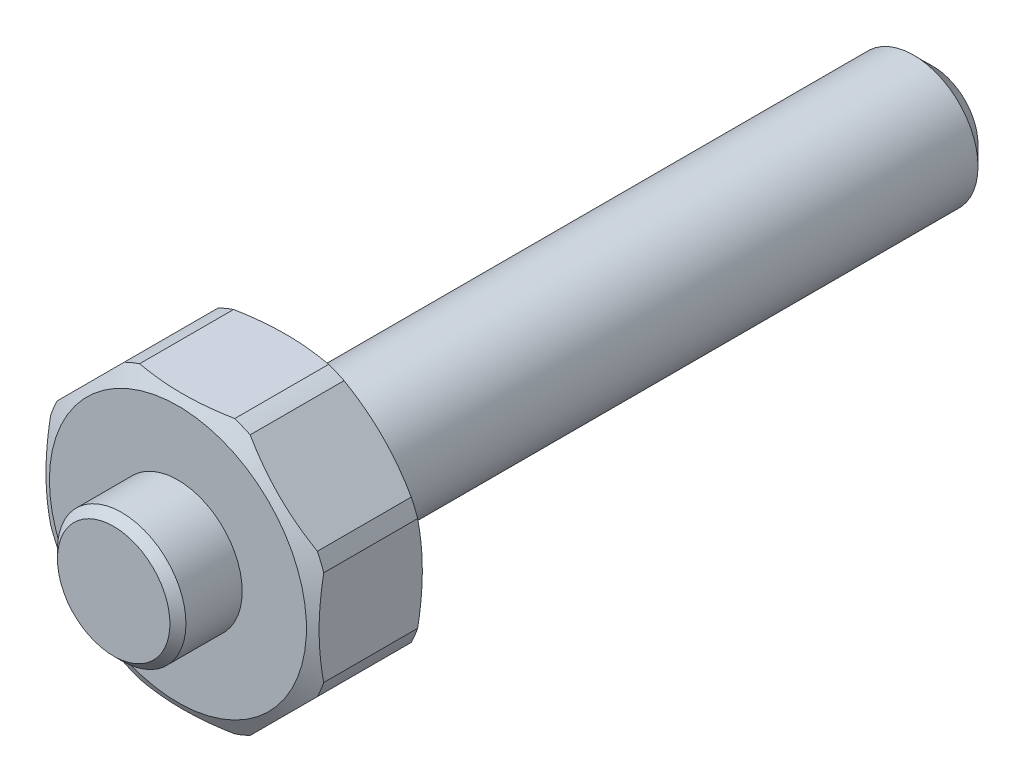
ISO-10303-21;
HEADER;
FILE_DESCRIPTION(('STEP AP214'),'2;1');
FILE_NAME('part.step','',(''),(''),'','','');
FILE_SCHEMA(('AUTOMOTIVE_DESIGN { 1 0 10303 214 1 1 1 1 }'));
ENDSEC;
DATA;
#1=APPLICATION_CONTEXT('core data for automotive mechanical design processes');
#2=APPLICATION_PROTOCOL_DEFINITION('international standard','automotive_design',2000,#1);
#3=PRODUCT_CONTEXT('',#1,'mechanical');
#4=PRODUCT('Part','Part','',(#3));
#5=PRODUCT_RELATED_PRODUCT_CATEGORY('part','',(#4));
#6=PRODUCT_DEFINITION_FORMATION('','',#4);
#7=PRODUCT_DEFINITION_CONTEXT('part definition',#1,'design');
#8=PRODUCT_DEFINITION('design','',#6,#7);
#9=PRODUCT_DEFINITION_SHAPE('','',#8);
#10=(LENGTH_UNIT() NAMED_UNIT(*) SI_UNIT(.MILLI.,.METRE.));
#11=(NAMED_UNIT(*) PLANE_ANGLE_UNIT() SI_UNIT($,.RADIAN.));
#12=(NAMED_UNIT(*) SI_UNIT($,.STERADIAN.) SOLID_ANGLE_UNIT());
#13=UNCERTAINTY_MEASURE_WITH_UNIT(LENGTH_MEASURE(1.E-05),#10,'distance_accuracy_value','');
#14=(GEOMETRIC_REPRESENTATION_CONTEXT(3) GLOBAL_UNCERTAINTY_ASSIGNED_CONTEXT((#13)) GLOBAL_UNIT_ASSIGNED_CONTEXT((#10,
#11,#12)) REPRESENTATION_CONTEXT('',''));
#15=CARTESIAN_POINT('',(0.,0.,0.));
#16=DIRECTION('',(0.,0.,1.));
#17=DIRECTION('',(1.,0.,0.));
#18=AXIS2_PLACEMENT_3D('',#15,#16,#17);
#19=CARTESIAN_POINT('',(4.,0.,0.));
#20=DIRECTION('',(0.,0.,1.));
#21=DIRECTION('',(1.,0.,0.));
#22=AXIS2_PLACEMENT_3D('',#19,#20,#21);
#23=PLANE('',#22);
#24=CARTESIAN_POINT('',(0.,0.,0.));
#25=DIRECTION('',(0.,0.,1.));
#26=DIRECTION('',(1.,0.,0.));
#27=AXIS2_PLACEMENT_3D('',#24,#25,#26);
#28=CIRCLE('',#27,4.);
#29=CARTESIAN_POINT('',(4.,0.,0.));
#30=VERTEX_POINT('',#29);
#31=EDGE_CURVE('E298',#30,#30,#28,.T.);
#32=ORIENTED_EDGE('',*,*,#31,.T.);
#33=EDGE_LOOP('',(#32));
#34=FACE_BOUND('',#33,.T.);
#35=CARTESIAN_POINT('',(0.,0.,0.));
#36=DIRECTION('',(0.,0.,-1.));
#37=DIRECTION('',(-1.,0.,0.));
#38=AXIS2_PLACEMENT_3D('',#35,#36,#37);
#39=CIRCLE('',#38,8.);
#40=CARTESIAN_POINT('',(-8.,0.,0.));
#41=VERTEX_POINT('',#40);
#42=EDGE_CURVE('E408',#41,#41,#39,.T.);
#43=ORIENTED_EDGE('',*,*,#42,.T.);
#44=EDGE_LOOP('',(#43));
#45=FACE_BOUND('',#44,.T.);
#46=ADVANCED_FACE('F14',(#34,#45),#23,.F.);
#47=CARTESIAN_POINT('',(0.,0.,-40.));
#48=DIRECTION('',(0.,0.,1.));
#49=DIRECTION('',(1.,0.,0.));
#50=AXIS2_PLACEMENT_3D('',#47,#48,#49);
#51=PLANE('',#50);
#52=CARTESIAN_POINT('',(0.,0.,-40.));
#53=DIRECTION('',(0.,0.,1.));
#54=DIRECTION('',(1.,0.,0.));
#55=AXIS2_PLACEMENT_3D('',#52,#53,#54);
#56=CIRCLE('',#55,2.8);
#57=CARTESIAN_POINT('',(2.8,0.,-40.));
#58=VERTEX_POINT('',#57);
#59=EDGE_CURVE('E310',#58,#58,#56,.F.);
#60=ORIENTED_EDGE('',*,*,#59,.T.);
#61=EDGE_LOOP('',(#60));
#62=FACE_BOUND('',#61,.T.);
#63=ADVANCED_FACE('F369',(#62),#51,.F.);
#64=CARTESIAN_POINT('',(0.,0.,40.));
#65=DIRECTION('',(0.,0.,1.));
#66=DIRECTION('',(1.,0.,0.));
#67=AXIS2_PLACEMENT_3D('',#64,#65,#66);
#68=CYLINDRICAL_SURFACE('',#67,4.);
#69=CARTESIAN_POINT('',(0.,0.,-38.8));
#70=DIRECTION('',(0.,0.,1.));
#71=DIRECTION('',(1.,0.,0.));
#72=AXIS2_PLACEMENT_3D('',#69,#70,#71);
#73=CIRCLE('',#72,4.);
#74=CARTESIAN_POINT('',(4.,0.,-38.8));
#75=VERTEX_POINT('',#74);
#76=EDGE_CURVE('E307',#75,#75,#73,.T.);
#77=ORIENTED_EDGE('',*,*,#76,.T.);
#78=EDGE_LOOP('',(#77));
#79=FACE_BOUND('',#78,.T.);
#80=ORIENTED_EDGE('',*,*,#31,.F.);
#81=EDGE_LOOP('',(#80));
#82=FACE_BOUND('',#81,.T.);
#83=ADVANCED_FACE('F376',(#79,#82),#68,.T.);
#84=CARTESIAN_POINT('',(0.,0.,-38.8));
#85=DIRECTION('',(0.,0.,1.));
#86=DIRECTION('',(1.,0.,0.));
#87=AXIS2_PLACEMENT_3D('',#84,#85,#86);
#88=CONICAL_SURFACE('',#87,4.,0.78539816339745);
#89=ORIENTED_EDGE('',*,*,#59,.F.);
#90=EDGE_LOOP('',(#89));
#91=FACE_BOUND('',#90,.T.);
#92=ORIENTED_EDGE('',*,*,#76,.F.);
#93=EDGE_LOOP('',(#92));
#94=FACE_BOUND('',#93,.T.);
#95=ADVANCED_FACE('F16',(#91,#94),#88,.T.);
#96=CARTESIAN_POINT('',(0.,0.,-40.));
#97=DIRECTION('',(0.,0.,-1.));
#98=DIRECTION('',(-1.,0.,0.));
#99=AXIS2_PLACEMENT_3D('',#96,#97,#98);
#100=CYLINDRICAL_SURFACE('',#99,9.);
#101=CARTESIAN_POINT('',(0.,0.,6.4226497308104));
#102=DIRECTION('',(0.,0.,-1.));
#103=DIRECTION('',(-1.,0.,0.));
#104=AXIS2_PLACEMENT_3D('',#101,#102,#103);
#105=CIRCLE('',#104,9.);
#106=CARTESIAN_POINT('',(3.91875757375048,-8.10205770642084,6.4226497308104));
#107=VERTEX_POINT('',#106);
#108=CARTESIAN_POINT('',(2.95803989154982,-8.5,6.4226497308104));
#109=VERTEX_POINT('',#108);
#110=EDGE_CURVE('E438',#107,#109,#105,.T.);
#111=ORIENTED_EDGE('',*,*,#110,.T.);
#112=DIRECTION('',(0.,0.,-1.));
#113=VECTOR('',#112,1.);
#114=CARTESIAN_POINT('',(2.95803989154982,-8.5,-40.));
#115=LINE('',#114,#113);
#116=CARTESIAN_POINT('',(2.95803989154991,-8.5,0.57735026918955));
#117=VERTEX_POINT('',#116);
#118=EDGE_CURVE('E9',#109,#117,#115,.T.);
#119=ORIENTED_EDGE('',*,*,#118,.T.);
#120=CARTESIAN_POINT('',(0.,0.,0.577350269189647));
#121=DIRECTION('',(0.,0.,1.));
#122=DIRECTION('',(1.,0.,0.));
#123=AXIS2_PLACEMENT_3D('',#120,#121,#122);
#124=CIRCLE('',#123,9.);
#125=CARTESIAN_POINT('',(3.91875757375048,-8.10205770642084,0.577350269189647));
#126=VERTEX_POINT('',#125);
#127=EDGE_CURVE('E415',#117,#126,#124,.T.);
#128=ORIENTED_EDGE('',*,*,#127,.T.);
#129=DIRECTION('',(0.,0.,-1.));
#130=VECTOR('',#129,1.);
#131=CARTESIAN_POINT('',(3.91875757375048,-8.10205770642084,-40.));
#132=LINE('',#131,#130);
#133=EDGE_CURVE('E292',#107,#126,#132,.T.);
#134=ORIENTED_EDGE('',*,*,#133,.F.);
#135=EDGE_LOOP('',(#111,#119,#128,#134));
#136=FACE_BOUND('',#135,.T.);
#137=ADVANCED_FACE('F462',(#136),#100,.T.);
#138=CARTESIAN_POINT('',(8.10205770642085,-3.91875757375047,0.577350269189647));
#139=VERTEX_POINT('',#138);
#140=CARTESIAN_POINT('',(8.5,-2.95803989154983,0.577350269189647));
#141=VERTEX_POINT('',#140);
#142=EDGE_CURVE('E29',#139,#141,#124,.T.);
#143=ORIENTED_EDGE('',*,*,#142,.T.);
#144=DIRECTION('',(0.,0.,-1.));
#145=VECTOR('',#144,1.);
#146=CARTESIAN_POINT('',(8.5,-2.95803989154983,-40.));
#147=LINE('',#146,#145);
#148=CARTESIAN_POINT('',(8.5,-2.95803989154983,6.4226497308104));
#149=VERTEX_POINT('',#148);
#150=EDGE_CURVE('E286',#149,#141,#147,.T.);
#151=ORIENTED_EDGE('',*,*,#150,.F.);
#152=CARTESIAN_POINT('',(8.10205770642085,-3.91875757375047,6.4226497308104));
#153=VERTEX_POINT('',#152);
#154=EDGE_CURVE('E442',#149,#153,#105,.T.);
#155=ORIENTED_EDGE('',*,*,#154,.T.);
#156=DIRECTION('',(0.,0.,-1.));
#157=VECTOR('',#156,1.);
#158=CARTESIAN_POINT('',(8.10205770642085,-3.91875757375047,-40.));
#159=LINE('',#158,#157);
#160=EDGE_CURVE('E289',#139,#153,#159,.F.);
#161=ORIENTED_EDGE('',*,*,#160,.F.);
#162=EDGE_LOOP('',(#143,#151,#155,#161));
#163=FACE_BOUND('',#162,.T.);
#164=ADVANCED_FACE('F460',(#163),#100,.T.);
#165=CARTESIAN_POINT('',(8.5,2.95803989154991,0.57735026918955));
#166=VERTEX_POINT('',#165);
#167=CARTESIAN_POINT('',(8.10205770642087,3.91875757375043,0.577350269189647));
#168=VERTEX_POINT('',#167);
#169=EDGE_CURVE('E35',#166,#168,#124,.T.);
#170=ORIENTED_EDGE('',*,*,#169,.T.);
#171=DIRECTION('',(0.,0.,-1.));
#172=VECTOR('',#171,1.);
#173=CARTESIAN_POINT('',(8.10205770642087,3.91875757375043,-40.));
#174=LINE('',#173,#172);
#175=CARTESIAN_POINT('',(8.10205770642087,3.91875757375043,6.4226497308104));
#176=VERTEX_POINT('',#175);
#177=EDGE_CURVE('E280',#176,#168,#174,.T.);
#178=ORIENTED_EDGE('',*,*,#177,.F.);
#179=CARTESIAN_POINT('',(8.5,2.95803989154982,6.4226497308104));
#180=VERTEX_POINT('',#179);
#181=EDGE_CURVE('E446',#176,#180,#105,.T.);
#182=ORIENTED_EDGE('',*,*,#181,.T.);
#183=DIRECTION('',(0.,0.,-1.));
#184=VECTOR('',#183,1.);
#185=CARTESIAN_POINT('',(8.5,2.95803989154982,-40.));
#186=LINE('',#185,#184);
#187=EDGE_CURVE('E283',#166,#180,#186,.F.);
#188=ORIENTED_EDGE('',*,*,#187,.F.);
#189=EDGE_LOOP('',(#170,#178,#182,#188));
#190=FACE_BOUND('',#189,.T.);
#191=ADVANCED_FACE('F457',(#190),#100,.T.);
#192=CARTESIAN_POINT('',(3.91875757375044,8.10205770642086,0.577350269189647));
#193=VERTEX_POINT('',#192);
#194=CARTESIAN_POINT('',(2.95803989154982,8.5,0.577350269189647));
#195=VERTEX_POINT('',#194);
#196=EDGE_CURVE('E411',#193,#195,#124,.T.);
#197=ORIENTED_EDGE('',*,*,#196,.T.);
#198=DIRECTION('',(0.,0.,-1.));
#199=VECTOR('',#198,1.);
#200=CARTESIAN_POINT('',(2.95803989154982,8.5,-40.));
#201=LINE('',#200,#199);
#202=CARTESIAN_POINT('',(2.95803989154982,8.5,6.4226497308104));
#203=VERTEX_POINT('',#202);
#204=EDGE_CURVE('E274',#203,#195,#201,.T.);
#205=ORIENTED_EDGE('',*,*,#204,.F.);
#206=CARTESIAN_POINT('',(3.91875757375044,8.10205770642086,6.4226497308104));
#207=VERTEX_POINT('',#206);
#208=EDGE_CURVE('E449',#203,#207,#105,.T.);
#209=ORIENTED_EDGE('',*,*,#208,.T.);
#210=DIRECTION('',(0.,0.,-1.));
#211=VECTOR('',#210,1.);
#212=CARTESIAN_POINT('',(3.91875757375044,8.10205770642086,-40.));
#213=LINE('',#212,#211);
#214=EDGE_CURVE('E277',#193,#207,#213,.F.);
#215=ORIENTED_EDGE('',*,*,#214,.F.);
#216=EDGE_LOOP('',(#197,#205,#209,#215));
#217=FACE_BOUND('',#216,.T.);
#218=ADVANCED_FACE('F468',(#217),#100,.T.);
#219=CARTESIAN_POINT('',(-2.95803989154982,8.5,0.577350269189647));
#220=VERTEX_POINT('',#219);
#221=CARTESIAN_POINT('',(-3.91875757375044,8.10205770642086,0.577350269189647));
#222=VERTEX_POINT('',#221);
#223=EDGE_CURVE('E414',#220,#222,#124,.T.);
#224=ORIENTED_EDGE('',*,*,#223,.T.);
#225=DIRECTION('',(0.,0.,-1.));
#226=VECTOR('',#225,1.);
#227=CARTESIAN_POINT('',(-3.91875757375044,8.10205770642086,-40.));
#228=LINE('',#227,#226);
#229=CARTESIAN_POINT('',(-3.91875757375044,8.10205770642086,6.4226497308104));
#230=VERTEX_POINT('',#229);
#231=EDGE_CURVE('E268',#230,#222,#228,.T.);
#232=ORIENTED_EDGE('',*,*,#231,.F.);
#233=CARTESIAN_POINT('',(-2.95803989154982,8.5,6.4226497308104));
#234=VERTEX_POINT('',#233);
#235=EDGE_CURVE('E150',#230,#234,#105,.T.);
#236=ORIENTED_EDGE('',*,*,#235,.T.);
#237=DIRECTION('',(0.,0.,-1.));
#238=VECTOR('',#237,1.);
#239=CARTESIAN_POINT('',(-2.95803989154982,8.5,-40.));
#240=LINE('',#239,#238);
#241=EDGE_CURVE('E271',#220,#234,#240,.F.);
#242=ORIENTED_EDGE('',*,*,#241,.F.);
#243=EDGE_LOOP('',(#224,#232,#236,#242));
#244=FACE_BOUND('',#243,.T.);
#245=ADVANCED_FACE('F430',(#244),#100,.T.);
#246=DIRECTION('',(0.,0.,-1.));
#247=VECTOR('',#246,1.);
#248=CARTESIAN_POINT('',(-8.5,-2.95803989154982,-40.));
#249=LINE('',#248,#247);
#250=CARTESIAN_POINT('',(-8.5,-2.95803989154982,6.4226497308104));
#251=VERTEX_POINT('',#250);
#252=CARTESIAN_POINT('',(-8.5,-2.95803989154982,0.577350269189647));
#253=VERTEX_POINT('',#252);
#254=EDGE_CURVE('E137',#251,#253,#249,.T.);
#255=ORIENTED_EDGE('',*,*,#254,.T.);
#256=CARTESIAN_POINT('',(-8.10205770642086,-3.91875757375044,0.577350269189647));
#257=VERTEX_POINT('',#256);
#258=EDGE_CURVE('E421',#253,#257,#124,.T.);
#259=ORIENTED_EDGE('',*,*,#258,.T.);
#260=DIRECTION('',(0.,0.,-1.));
#261=VECTOR('',#260,1.);
#262=CARTESIAN_POINT('',(-8.10205770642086,-3.91875757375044,-40.));
#263=LINE('',#262,#261);
#264=CARTESIAN_POINT('',(-8.10205770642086,-3.91875757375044,6.4226497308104));
#265=VERTEX_POINT('',#264);
#266=EDGE_CURVE('E261',#257,#265,#263,.F.);
#267=ORIENTED_EDGE('',*,*,#266,.T.);
#268=EDGE_CURVE('E152',#265,#251,#105,.T.);
#269=ORIENTED_EDGE('',*,*,#268,.T.);
#270=EDGE_LOOP('',(#255,#259,#267,#269));
#271=FACE_BOUND('',#270,.T.);
#272=ADVANCED_FACE('F435',(#271),#100,.T.);
#273=CARTESIAN_POINT('',(-8.10205770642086,3.91875757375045,0.577350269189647));
#274=VERTEX_POINT('',#273);
#275=CARTESIAN_POINT('',(-8.5,2.95803989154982,0.577350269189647));
#276=VERTEX_POINT('',#275);
#277=EDGE_CURVE('E133',#274,#276,#124,.T.);
#278=ORIENTED_EDGE('',*,*,#277,.T.);
#279=DIRECTION('',(0.,0.,-1.));
#280=VECTOR('',#279,1.);
#281=CARTESIAN_POINT('',(-8.5,2.95803989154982,-40.));
#282=LINE('',#281,#280);
#283=CARTESIAN_POINT('',(-8.5,2.95803989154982,6.4226497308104));
#284=VERTEX_POINT('',#283);
#285=EDGE_CURVE('E127',#276,#284,#282,.F.);
#286=ORIENTED_EDGE('',*,*,#285,.T.);
#287=CARTESIAN_POINT('',(-8.10205770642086,3.91875757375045,6.4226497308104));
#288=VERTEX_POINT('',#287);
#289=EDGE_CURVE('E131',#284,#288,#105,.T.);
#290=ORIENTED_EDGE('',*,*,#289,.T.);
#291=DIRECTION('',(0.,0.,-1.));
#292=VECTOR('',#291,1.);
#293=CARTESIAN_POINT('',(-8.10205770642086,3.91875757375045,-40.));
#294=LINE('',#293,#292);
#295=EDGE_CURVE('E266',#274,#288,#294,.F.);
#296=ORIENTED_EDGE('',*,*,#295,.F.);
#297=EDGE_LOOP('',(#278,#286,#290,#296));
#298=FACE_BOUND('',#297,.T.);
#299=ADVANCED_FACE('F129',(#298),#100,.T.);
#300=DIRECTION('',(0.,0.,-1.));
#301=VECTOR('',#300,1.);
#302=CARTESIAN_POINT('',(-3.91875757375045,-8.10205770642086,-40.));
#303=LINE('',#302,#301);
#304=CARTESIAN_POINT('',(-3.91875757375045,-8.10205770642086,6.4226497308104));
#305=VERTEX_POINT('',#304);
#306=CARTESIAN_POINT('',(-3.91875757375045,-8.10205770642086,0.577350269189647));
#307=VERTEX_POINT('',#306);
#308=EDGE_CURVE('E138',#305,#307,#303,.T.);
#309=ORIENTED_EDGE('',*,*,#308,.T.);
#310=CARTESIAN_POINT('',(-2.95803989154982,-8.5,0.577350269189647));
#311=VERTEX_POINT('',#310);
#312=EDGE_CURVE('E418',#307,#311,#124,.T.);
#313=ORIENTED_EDGE('',*,*,#312,.T.);
#314=DIRECTION('',(0.,0.,-1.));
#315=VECTOR('',#314,1.);
#316=CARTESIAN_POINT('',(-2.95803989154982,-8.5,-40.));
#317=LINE('',#316,#315);
#318=CARTESIAN_POINT('',(-2.95803989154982,-8.5,6.4226497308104));
#319=VERTEX_POINT('',#318);
#320=EDGE_CURVE('E22',#311,#319,#317,.F.);
#321=ORIENTED_EDGE('',*,*,#320,.T.);
#322=EDGE_CURVE('E436',#319,#305,#105,.T.);
#323=ORIENTED_EDGE('',*,*,#322,.T.);
#324=EDGE_LOOP('',(#309,#313,#321,#323));
#325=FACE_BOUND('',#324,.T.);
#326=ADVANCED_FACE('F469',(#325),#100,.T.);
#327=CARTESIAN_POINT('',(0.,0.,1.7223750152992));
#328=DIRECTION('',(0.,0.,1.));
#329=DIRECTION('',(1.,0.,0.));
#330=AXIS2_PLACEMENT_3D('',#327,#328,#329);
#331=CONICAL_SURFACE('',#330,10.9832410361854,1.0471975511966);
#332=CARTESIAN_POINT('',(8.10280285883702,-3.9180124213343,0.577550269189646));
#333=CARTESIAN_POINT('',(7.95991753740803,-4.06089774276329,0.539178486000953));
#334=CARTESIAN_POINT('',(7.81656017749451,-4.2042551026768,0.504212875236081));
#335=CARTESIAN_POINT('',(7.5290154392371,-4.49179984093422,0.441634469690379));
#336=CARTESIAN_POINT('',(7.38482788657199,-4.63598739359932,0.414023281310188));
#337=CARTESIAN_POINT('',(7.09575516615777,-4.92506011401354,0.366704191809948));
#338=CARTESIAN_POINT('',(6.95086979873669,-5.06994548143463,0.346998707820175));
#339=CARTESIAN_POINT('',(6.66066283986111,-5.36015244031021,0.315914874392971));
#340=CARTESIAN_POINT('',(6.51534128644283,-5.50547399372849,0.304535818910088));
#341=CARTESIAN_POINT('',(6.22660931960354,-5.79420596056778,0.290459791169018));
#342=CARTESIAN_POINT('',(6.08320194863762,-5.9376133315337,0.287638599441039));
#343=CARTESIAN_POINT('',(5.79642742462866,-6.22438785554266,0.290388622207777));
#344=CARTESIAN_POINT('',(5.65306027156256,-6.36775500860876,0.295959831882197));
#345=CARTESIAN_POINT('',(5.36668609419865,-6.65412918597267,0.315366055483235));
#346=CARTESIAN_POINT('',(5.22367891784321,-6.79713636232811,0.329196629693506));
#347=CARTESIAN_POINT('',(4.93817600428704,-7.08263927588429,0.364823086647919));
#348=CARTESIAN_POINT('',(4.79568021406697,-7.22513506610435,0.386618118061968));
#349=CARTESIAN_POINT('',(4.59205039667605,-7.42876488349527,0.423230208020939));
#350=CARTESIAN_POINT('',(4.53063343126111,-7.49018184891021,0.43498843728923));
#351=CARTESIAN_POINT('',(4.40794459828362,-7.6128706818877,0.459869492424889));
#352=CARTESIAN_POINT('',(4.34667271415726,-7.67414256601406,0.472992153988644));
#353=CARTESIAN_POINT('',(4.22407870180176,-7.79673657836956,0.50060459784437));
#354=CARTESIAN_POINT('',(4.16275706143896,-7.85805821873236,0.515098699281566));
#355=CARTESIAN_POINT('',(4.04026659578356,-7.98054868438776,0.545372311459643));
#356=CARTESIAN_POINT('',(3.97909778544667,-8.04171749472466,0.561151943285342));
#357=CARTESIAN_POINT('',(3.91801242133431,-8.10280285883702,0.577550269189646));
#358=B_SPLINE_CURVE_WITH_KNOTS('',3,(#332,#333,#334,#335,#336,#337,#338,#339,#340,#341,#342,
#343,#344,#345,#346,#347,#348,#349,#350,#351,#352,#353,#354,#355,#356,#357),.UNSPECIFIED.,.F.,
.F.,(4,2,2,2,2,2,2,2,2,2,2,2,4),(0.,0.617045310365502,1.23422528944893,1.8515938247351,
2.46891000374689,3.07722174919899,3.68553314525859,4.29351784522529,4.90143757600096,
5.16437645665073,5.42728371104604,5.69104841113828,5.95483798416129),.UNSPECIFIED.);
#359=EDGE_CURVE('E249',#139,#126,#358,.T.);
#360=ORIENTED_EDGE('',*,*,#359,.T.);
#361=ORIENTED_EDGE('',*,*,#127,.F.);
#362=CARTESIAN_POINT('',(-10.6070347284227,-8.5,3.228897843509));
#363=CARTESIAN_POINT('',(-10.284692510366,-8.5,3.0837183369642));
#364=CARTESIAN_POINT('',(-9.96139755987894,-8.5,2.94060656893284));
#365=CARTESIAN_POINT('',(-9.31246034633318,-8.5,2.65959666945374));
#366=CARTESIAN_POINT('',(-8.98681753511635,-8.5,2.52169980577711));
#367=CARTESIAN_POINT('',(-8.33095650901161,-8.5,2.25146909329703));
#368=CARTESIAN_POINT('',(-8.00072260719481,-8.5,2.11917314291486));
#369=CARTESIAN_POINT('',(-7.33718521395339,-8.5,1.86254447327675));
#370=CARTESIAN_POINT('',(-7.00388192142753,-8.5,1.73821124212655));
#371=CARTESIAN_POINT('',(-6.33722971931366,-8.5,1.50063229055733));
#372=CARTESIAN_POINT('',(-6.00391734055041,-8.5,1.38728470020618));
#373=CARTESIAN_POINT('',(-5.33341965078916,-8.5,1.17250067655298));
#374=CARTESIAN_POINT('',(-4.99623405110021,-8.5,1.07106513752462));
#375=CARTESIAN_POINT('',(-4.31850077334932,-8.5,0.883057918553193));
#376=CARTESIAN_POINT('',(-3.97796219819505,-8.5,0.796453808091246));
#377=CARTESIAN_POINT('',(-3.29292622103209,-8.5,0.640925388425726));
#378=CARTESIAN_POINT('',(-2.94842980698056,-8.5,0.571996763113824));
#379=CARTESIAN_POINT('',(-2.2044356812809,-8.5,0.446287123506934));
#380=CARTESIAN_POINT('',(-1.80435585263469,-8.5,0.392822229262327));
#381=CARTESIAN_POINT('',(-1.20205535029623,-8.5,0.336178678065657));
#382=CARTESIAN_POINT('',(-1.00089583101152,-8.5,0.321222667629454));
#383=CARTESIAN_POINT('',(-0.598123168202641,-8.5,0.299449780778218));
#384=CARTESIAN_POINT('',(-0.396510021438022,-8.5,0.292632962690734));
#385=CARTESIAN_POINT('',(0.00699907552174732,-8.5,0.287293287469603));
#386=CARTESIAN_POINT('',(0.208895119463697,-8.5,0.288777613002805));
#387=CARTESIAN_POINT('',(0.612453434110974,-8.5,0.300021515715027));
#388=CARTESIAN_POINT('',(0.814115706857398,-8.5,0.309781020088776));
#389=CARTESIAN_POINT('',(1.21682155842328,-8.5,0.337362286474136));
#390=CARTESIAN_POINT('',(1.41786531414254,-8.5,0.355181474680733));
#391=CARTESIAN_POINT('',(1.81912904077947,-8.5,0.398512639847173));
#392=CARTESIAN_POINT('',(2.01934893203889,-8.5,0.424025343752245));
#393=CARTESIAN_POINT('',(2.63799122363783,-8.5,0.51425776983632));
#394=CARTESIAN_POINT('',(3.05465650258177,-8.5,0.591271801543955));
#395=CARTESIAN_POINT('',(3.8822482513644,-8.5,0.771762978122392));
#396=CARTESIAN_POINT('',(4.29317189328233,-8.5,0.875252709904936));
#397=CARTESIAN_POINT('',(5.11065144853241,-8.5,1.10367678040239));
#398=CARTESIAN_POINT('',(5.51718437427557,-8.5,1.22869236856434));
#399=CARTESIAN_POINT('',(6.32469598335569,-8.5,1.49517104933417));
#400=CARTESIAN_POINT('',(6.72567542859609,-8.5,1.63663186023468));
#401=CARTESIAN_POINT('',(7.52776878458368,-8.5,1.9341030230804));
#402=CARTESIAN_POINT('',(7.92882391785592,-8.5,2.09027066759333));
#403=CARTESIAN_POINT('',(8.72686086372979,-8.5,2.41271981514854));
#404=CARTESIAN_POINT('',(9.12384233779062,-8.5,2.57900215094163));
#405=CARTESIAN_POINT('',(9.91056361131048,-8.5,2.91780454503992));
#406=CARTESIAN_POINT('',(10.3003363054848,-8.5,3.09024850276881));
#407=CARTESIAN_POINT('',(10.8828523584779,-8.5,3.35348170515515));
#408=CARTESIAN_POINT('',(11.0766392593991,-8.5,3.44197415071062));
#409=CARTESIAN_POINT('',(11.4635756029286,-8.5,3.62033244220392));
#410=CARTESIAN_POINT('',(11.6567250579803,-8.5,3.7101982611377));
#411=CARTESIAN_POINT('',(11.8495884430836,-8.5,3.80067420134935));
#412=B_SPLINE_CURVE_WITH_KNOTS('',3,(#362,#363,#364,#365,#366,#367,#368,#369,#370,#371,#372,
#373,#374,#375,#376,#377,#378,#379,#380,#381,#382,#383,#384,#385,#386,#387,#388,#389,#390,#391,
#392,#393,#394,#395,#396,#397,#398,#399,#400,#401,#402,#403,#404,#405,#406,#407,#408,#409,#410,
#411),.UNSPECIFIED.,.F.,.F.,(4,2,2,2,2,2,2,2,2,2,2,2,2,2,2,2,2,2,2,2,2,2,2,2,4),(0.,
1.06060399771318,2.12146419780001,3.18862423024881,4.25571558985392,5.31170823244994,
6.36778010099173,7.42151242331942,8.47498719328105,9.68464991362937,10.2896561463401,
10.8946667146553,11.5002008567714,12.1057296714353,12.7110652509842,13.3164580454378,
14.586456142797,15.8570591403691,17.1325676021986,18.4078993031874,19.6988870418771,
20.9899812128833,22.2685587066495,22.9076620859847,23.5467529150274),.UNSPECIFIED.);
#413=EDGE_CURVE('E313',#311,#117,#412,.T.);
#414=ORIENTED_EDGE('',*,*,#413,.F.);
#415=ORIENTED_EDGE('',*,*,#312,.F.);
#416=CARTESIAN_POINT('',(-8.10280285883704,-3.91801242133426,0.577550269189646));
#417=CARTESIAN_POINT('',(-7.95991753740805,-4.06089774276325,0.539178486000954));
#418=CARTESIAN_POINT('',(-7.81656017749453,-4.20425510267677,0.504212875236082));
#419=CARTESIAN_POINT('',(-7.52901543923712,-4.49179984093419,0.441634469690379));
#420=CARTESIAN_POINT('',(-7.38482788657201,-4.63598739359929,0.414023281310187));
#421=CARTESIAN_POINT('',(-7.09575516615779,-4.92506011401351,0.366704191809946));
#422=CARTESIAN_POINT('',(-6.95086979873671,-5.06994548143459,0.346998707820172));
#423=CARTESIAN_POINT('',(-6.66066283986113,-5.36015244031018,0.315914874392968));
#424=CARTESIAN_POINT('',(-6.51534128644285,-5.50547399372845,0.304535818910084));
#425=CARTESIAN_POINT('',(-6.22660931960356,-5.79420596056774,0.290459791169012));
#426=CARTESIAN_POINT('',(-6.08320194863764,-5.93761333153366,0.287638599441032));
#427=CARTESIAN_POINT('',(-5.79642742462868,-6.22438785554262,0.29038862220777));
#428=CARTESIAN_POINT('',(-5.65306027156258,-6.36775500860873,0.29595983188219));
#429=CARTESIAN_POINT('',(-5.36668609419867,-6.65412918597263,0.315366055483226));
#430=CARTESIAN_POINT('',(-5.22367891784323,-6.79713636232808,0.329196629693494));
#431=CARTESIAN_POINT('',(-4.93817600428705,-7.08263927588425,0.364823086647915));
#432=CARTESIAN_POINT('',(-4.79568021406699,-7.22513506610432,0.386618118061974));
#433=CARTESIAN_POINT('',(-4.59205039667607,-7.42876488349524,0.423230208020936));
#434=CARTESIAN_POINT('',(-4.53063343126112,-7.49018184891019,0.434988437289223));
#435=CARTESIAN_POINT('',(-4.40794459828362,-7.61287068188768,0.459869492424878));
#436=CARTESIAN_POINT('',(-4.34667271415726,-7.67414256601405,0.472992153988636));
#437=CARTESIAN_POINT('',(-4.22407870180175,-7.79673657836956,0.500604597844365));
#438=CARTESIAN_POINT('',(-4.16275706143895,-7.85805821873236,0.515098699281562));
#439=CARTESIAN_POINT('',(-4.04026659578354,-7.98054868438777,0.545372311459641));
#440=CARTESIAN_POINT('',(-3.97909778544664,-8.04171749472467,0.561151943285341));
#441=CARTESIAN_POINT('',(-3.91801242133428,-8.10280285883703,0.577550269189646));
#442=B_SPLINE_CURVE_WITH_KNOTS('',3,(#416,#417,#418,#419,#420,#421,#422,#423,#424,#425,#426,
#427,#428,#429,#430,#431,#432,#433,#434,#435,#436,#437,#438,#439,#440,#441),.UNSPECIFIED.,.F.,
.F.,(4,2,2,2,2,2,2,2,2,2,2,2,4),(0.,0.617045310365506,1.23422528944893,1.8515938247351,
2.46891000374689,3.07722174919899,3.68553314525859,4.29351784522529,4.90143757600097,
5.16437645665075,5.42728371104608,5.69104841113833,5.95483798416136),.UNSPECIFIED.);
#443=EDGE_CURVE('E328',#257,#307,#442,.T.);
#444=ORIENTED_EDGE('',*,*,#443,.F.);
#445=ORIENTED_EDGE('',*,*,#258,.F.);
#446=CARTESIAN_POINT('',(-8.5,-10.6070347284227,3.228897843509));
#447=CARTESIAN_POINT('',(-8.5,-10.284692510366,3.0837183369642));
#448=CARTESIAN_POINT('',(-8.5,-9.96139755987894,2.94060656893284));
#449=CARTESIAN_POINT('',(-8.5,-9.31246034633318,2.65959666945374));
#450=CARTESIAN_POINT('',(-8.5,-8.98681753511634,2.52169980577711));
#451=CARTESIAN_POINT('',(-8.5,-8.33095650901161,2.25146909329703));
#452=CARTESIAN_POINT('',(-8.5,-8.00072260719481,2.11917314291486));
#453=CARTESIAN_POINT('',(-8.5,-7.33718521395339,1.86254447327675));
#454=CARTESIAN_POINT('',(-8.5,-7.00388192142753,1.73821124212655));
#455=CARTESIAN_POINT('',(-8.5,-6.33722971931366,1.50063229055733));
#456=CARTESIAN_POINT('',(-8.5,-6.00391734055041,1.38728470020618));
#457=CARTESIAN_POINT('',(-8.5,-5.33341965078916,1.17250067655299));
#458=CARTESIAN_POINT('',(-8.5,-4.99623405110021,1.07106513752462));
#459=CARTESIAN_POINT('',(-8.5,-4.31850077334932,0.883057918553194));
#460=CARTESIAN_POINT('',(-8.5,-3.97796219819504,0.796453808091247));
#461=CARTESIAN_POINT('',(-8.5,-3.29292622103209,0.640925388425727));
#462=CARTESIAN_POINT('',(-8.5,-2.94842980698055,0.571996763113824));
#463=CARTESIAN_POINT('',(-8.5,-2.2044356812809,0.446287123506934));
#464=CARTESIAN_POINT('',(-8.5,-1.80435585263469,0.392822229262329));
#465=CARTESIAN_POINT('',(-8.5,-1.20205535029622,0.336178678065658));
#466=CARTESIAN_POINT('',(-8.5,-1.00089583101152,0.321222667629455));
#467=CARTESIAN_POINT('',(-8.5,-0.598123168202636,0.299449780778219));
#468=CARTESIAN_POINT('',(-8.5,-0.396510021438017,0.292632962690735));
#469=CARTESIAN_POINT('',(-8.5,0.00699907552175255,0.287293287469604));
#470=CARTESIAN_POINT('',(-8.5,0.208895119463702,0.288777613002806));
#471=CARTESIAN_POINT('',(-8.5,0.612453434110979,0.300021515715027));
#472=CARTESIAN_POINT('',(-8.5,0.814115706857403,0.309781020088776));
#473=CARTESIAN_POINT('',(-8.5,1.21682155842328,0.337362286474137));
#474=CARTESIAN_POINT('',(-8.5,1.41786531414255,0.355181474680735));
#475=CARTESIAN_POINT('',(-8.5,1.81912904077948,0.398512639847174));
#476=CARTESIAN_POINT('',(-8.5,2.01934893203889,0.424025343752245));
#477=CARTESIAN_POINT('',(-8.5,2.63799122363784,0.514257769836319));
#478=CARTESIAN_POINT('',(-8.5,3.05465650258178,0.591271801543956));
#479=CARTESIAN_POINT('',(-8.5,3.8822482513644,0.771762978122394));
#480=CARTESIAN_POINT('',(-8.5,4.29317189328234,0.875252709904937));
#481=CARTESIAN_POINT('',(-8.5,5.11065144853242,1.10367678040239));
#482=CARTESIAN_POINT('',(-8.5,5.51718437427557,1.22869236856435));
#483=CARTESIAN_POINT('',(-8.5,6.3246959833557,1.49517104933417));
#484=CARTESIAN_POINT('',(-8.5,6.7256754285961,1.63663186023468));
#485=CARTESIAN_POINT('',(-8.5,7.52776878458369,1.9341030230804));
#486=CARTESIAN_POINT('',(-8.5,7.92882391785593,2.09027066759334));
#487=CARTESIAN_POINT('',(-8.5,8.7268608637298,2.41271981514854));
#488=CARTESIAN_POINT('',(-8.5,9.12384233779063,2.57900215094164));
#489=CARTESIAN_POINT('',(-8.5,9.91056361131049,2.91780454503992));
#490=CARTESIAN_POINT('',(-8.5,10.3003363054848,3.09024850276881));
#491=CARTESIAN_POINT('',(-8.5,10.8828523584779,3.35348170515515));
#492=CARTESIAN_POINT('',(-8.5,11.0766392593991,3.44197415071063));
#493=CARTESIAN_POINT('',(-8.5,11.4635756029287,3.62033244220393));
#494=CARTESIAN_POINT('',(-8.5,11.6567250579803,3.7101982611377));
#495=CARTESIAN_POINT('',(-8.5,11.8495884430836,3.80067420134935));
#496=B_SPLINE_CURVE_WITH_KNOTS('',3,(#446,#447,#448,#449,#450,#451,#452,#453,#454,#455,#456,
#457,#458,#459,#460,#461,#462,#463,#464,#465,#466,#467,#468,#469,#470,#471,#472,#473,#474,#475,
#476,#477,#478,#479,#480,#481,#482,#483,#484,#485,#486,#487,#488,#489,#490,#491,#492,#493,#494,
#495),.UNSPECIFIED.,.F.,.F.,(4,2,2,2,2,2,2,2,2,2,2,2,2,2,2,2,2,2,2,2,2,2,2,2,4),(0.,
1.06060399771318,2.12146419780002,3.18862423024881,4.25571558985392,5.31170823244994,
6.36778010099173,7.42151242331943,8.47498719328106,9.68464991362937,10.2896561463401,
10.8946667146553,11.5002008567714,12.1057296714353,12.7110652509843,13.3164580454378,
14.586456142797,15.8570591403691,17.1325676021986,18.4078993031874,19.6988870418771,
20.9899812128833,22.2685587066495,22.9076620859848,23.5467529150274),.UNSPECIFIED.);
#497=EDGE_CURVE('E335',#276,#253,#496,.F.);
#498=ORIENTED_EDGE('',*,*,#497,.F.);
#499=ORIENTED_EDGE('',*,*,#277,.F.);
#500=CARTESIAN_POINT('',(-8.10280285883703,3.91801242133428,0.577550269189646));
#501=CARTESIAN_POINT('',(-7.95991753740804,4.06089774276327,0.539178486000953));
#502=CARTESIAN_POINT('',(-7.81656017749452,4.20425510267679,0.504212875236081));
#503=CARTESIAN_POINT('',(-7.5290154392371,4.4917998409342,0.441634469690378));
#504=CARTESIAN_POINT('',(-7.384827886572,4.63598739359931,0.414023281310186));
#505=CARTESIAN_POINT('',(-7.09575516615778,4.92506011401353,0.366704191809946));
#506=CARTESIAN_POINT('',(-6.9508697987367,5.06994548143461,0.346998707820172));
#507=CARTESIAN_POINT('',(-6.66066283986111,5.3601524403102,0.315914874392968));
#508=CARTESIAN_POINT('',(-6.51534128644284,5.50547399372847,0.304535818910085));
#509=CARTESIAN_POINT('',(-6.22660931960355,5.79420596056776,0.290459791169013));
#510=CARTESIAN_POINT('',(-6.08320194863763,5.93761333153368,0.287638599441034));
#511=CARTESIAN_POINT('',(-5.79642742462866,6.22438785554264,0.290388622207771));
#512=CARTESIAN_POINT('',(-5.65306027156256,6.36775500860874,0.295959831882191));
#513=CARTESIAN_POINT('',(-5.36668609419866,6.65412918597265,0.315366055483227));
#514=CARTESIAN_POINT('',(-5.22367891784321,6.79713636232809,0.329196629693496));
#515=CARTESIAN_POINT('',(-4.93817600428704,7.08263927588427,0.364823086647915));
#516=CARTESIAN_POINT('',(-4.79568021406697,7.22513506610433,0.386618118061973));
#517=CARTESIAN_POINT('',(-4.59205039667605,7.42876488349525,0.423230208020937));
#518=CARTESIAN_POINT('',(-4.53063343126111,7.4901818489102,0.434988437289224));
#519=CARTESIAN_POINT('',(-4.40794459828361,7.61287068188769,0.459869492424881));
#520=CARTESIAN_POINT('',(-4.34667271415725,7.67414256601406,0.472992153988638));
#521=CARTESIAN_POINT('',(-4.22407870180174,7.79673657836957,0.500604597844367));
#522=CARTESIAN_POINT('',(-4.16275706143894,7.85805821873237,0.515098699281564));
#523=CARTESIAN_POINT('',(-4.04026659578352,7.98054868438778,0.545372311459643));
#524=CARTESIAN_POINT('',(-3.97909778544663,8.04171749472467,0.561151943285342));
#525=CARTESIAN_POINT('',(-3.91801242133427,8.10280285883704,0.577550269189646));
#526=B_SPLINE_CURVE_WITH_KNOTS('',3,(#500,#501,#502,#503,#504,#505,#506,#507,#508,#509,#510,
#511,#512,#513,#514,#515,#516,#517,#518,#519,#520,#521,#522,#523,#524,#525),.UNSPECIFIED.,.F.,
.F.,(4,2,2,2,2,2,2,2,2,2,2,2,4),(0.,0.617045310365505,1.23422528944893,1.8515938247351,
2.46891000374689,3.07722174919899,3.68553314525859,4.29351784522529,4.90143757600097,
5.16437645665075,5.42728371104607,5.69104841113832,5.95483798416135),.UNSPECIFIED.);
#527=EDGE_CURVE('E341',#274,#222,#526,.T.);
#528=ORIENTED_EDGE('',*,*,#527,.T.);
#529=ORIENTED_EDGE('',*,*,#223,.F.);
#530=CARTESIAN_POINT('',(-10.6070347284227,8.5,3.228897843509));
#531=CARTESIAN_POINT('',(-10.284692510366,8.5,3.0837183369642));
#532=CARTESIAN_POINT('',(-9.96139755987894,8.5,2.94060656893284));
#533=CARTESIAN_POINT('',(-9.31246034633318,8.5,2.65959666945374));
#534=CARTESIAN_POINT('',(-8.98681753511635,8.5,2.52169980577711));
#535=CARTESIAN_POINT('',(-8.33095650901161,8.5,2.25146909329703));
#536=CARTESIAN_POINT('',(-8.00072260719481,8.5,2.11917314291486));
#537=CARTESIAN_POINT('',(-7.33718521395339,8.5,1.86254447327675));
#538=CARTESIAN_POINT('',(-7.00388192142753,8.5,1.73821124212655));
#539=CARTESIAN_POINT('',(-6.33722971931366,8.5,1.50063229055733));
#540=CARTESIAN_POINT('',(-6.00391734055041,8.5,1.38728470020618));
#541=CARTESIAN_POINT('',(-5.33341965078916,8.5,1.17250067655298));
#542=CARTESIAN_POINT('',(-4.99623405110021,8.5,1.07106513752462));
#543=CARTESIAN_POINT('',(-4.31850077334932,8.5,0.883057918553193));
#544=CARTESIAN_POINT('',(-3.97796219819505,8.5,0.796453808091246));
#545=CARTESIAN_POINT('',(-3.29292622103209,8.5,0.640925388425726));
#546=CARTESIAN_POINT('',(-2.94842980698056,8.5,0.571996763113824));
#547=CARTESIAN_POINT('',(-2.2044356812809,8.5,0.446287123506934));
#548=CARTESIAN_POINT('',(-1.80435585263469,8.5,0.392822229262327));
#549=CARTESIAN_POINT('',(-1.20205535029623,8.5,0.336178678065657));
#550=CARTESIAN_POINT('',(-1.00089583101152,8.5,0.321222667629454));
#551=CARTESIAN_POINT('',(-0.598123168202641,8.5,0.299449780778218));
#552=CARTESIAN_POINT('',(-0.396510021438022,8.5,0.292632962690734));
#553=CARTESIAN_POINT('',(0.00699907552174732,8.5,0.287293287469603));
#554=CARTESIAN_POINT('',(0.208895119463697,8.5,0.288777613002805));
#555=CARTESIAN_POINT('',(0.612453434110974,8.5,0.300021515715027));
#556=CARTESIAN_POINT('',(0.814115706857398,8.5,0.309781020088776));
#557=CARTESIAN_POINT('',(1.21682155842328,8.5,0.337362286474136));
#558=CARTESIAN_POINT('',(1.41786531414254,8.5,0.355181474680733));
#559=CARTESIAN_POINT('',(1.81912904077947,8.5,0.398512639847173));
#560=CARTESIAN_POINT('',(2.01934893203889,8.5,0.424025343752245));
#561=CARTESIAN_POINT('',(2.63799122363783,8.5,0.51425776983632));
#562=CARTESIAN_POINT('',(3.05465650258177,8.5,0.591271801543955));
#563=CARTESIAN_POINT('',(3.8822482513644,8.5,0.771762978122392));
#564=CARTESIAN_POINT('',(4.29317189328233,8.5,0.875252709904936));
#565=CARTESIAN_POINT('',(5.11065144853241,8.5,1.10367678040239));
#566=CARTESIAN_POINT('',(5.51718437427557,8.5,1.22869236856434));
#567=CARTESIAN_POINT('',(6.32469598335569,8.5,1.49517104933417));
#568=CARTESIAN_POINT('',(6.72567542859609,8.5,1.63663186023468));
#569=CARTESIAN_POINT('',(7.52776878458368,8.5,1.9341030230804));
#570=CARTESIAN_POINT('',(7.92882391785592,8.5,2.09027066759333));
#571=CARTESIAN_POINT('',(8.72686086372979,8.5,2.41271981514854));
#572=CARTESIAN_POINT('',(9.12384233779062,8.5,2.57900215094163));
#573=CARTESIAN_POINT('',(9.91056361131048,8.5,2.91780454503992));
#574=CARTESIAN_POINT('',(10.3003363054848,8.5,3.09024850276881));
#575=CARTESIAN_POINT('',(10.8828523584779,8.5,3.35348170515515));
#576=CARTESIAN_POINT('',(11.0766392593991,8.5,3.44197415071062));
#577=CARTESIAN_POINT('',(11.4635756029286,8.5,3.62033244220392));
#578=CARTESIAN_POINT('',(11.6567250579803,8.5,3.7101982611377));
#579=CARTESIAN_POINT('',(11.8495884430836,8.5,3.80067420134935));
#580=B_SPLINE_CURVE_WITH_KNOTS('',3,(#530,#531,#532,#533,#534,#535,#536,#537,#538,#539,#540,
#541,#542,#543,#544,#545,#546,#547,#548,#549,#550,#551,#552,#553,#554,#555,#556,#557,#558,#559,
#560,#561,#562,#563,#564,#565,#566,#567,#568,#569,#570,#571,#572,#573,#574,#575,#576,#577,#578,
#579),.UNSPECIFIED.,.F.,.F.,(4,2,2,2,2,2,2,2,2,2,2,2,2,2,2,2,2,2,2,2,2,2,2,2,4),(0.,
1.06060399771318,2.12146419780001,3.18862423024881,4.25571558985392,5.31170823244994,
6.36778010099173,7.42151242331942,8.47498719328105,9.68464991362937,10.2896561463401,
10.8946667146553,11.5002008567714,12.1057296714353,12.7110652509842,13.3164580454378,
14.586456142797,15.8570591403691,17.1325676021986,18.4078993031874,19.6988870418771,
20.9899812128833,22.2685587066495,22.9076620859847,23.5467529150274),.UNSPECIFIED.);
#581=EDGE_CURVE('E346',#220,#195,#580,.T.);
#582=ORIENTED_EDGE('',*,*,#581,.T.);
#583=ORIENTED_EDGE('',*,*,#196,.F.);
#584=CARTESIAN_POINT('',(3.91801242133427,8.10280285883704,0.577550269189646));
#585=CARTESIAN_POINT('',(4.06089774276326,7.95991753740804,0.539178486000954));
#586=CARTESIAN_POINT('',(4.20425510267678,7.81656017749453,0.504212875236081));
#587=CARTESIAN_POINT('',(4.49179984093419,7.52901543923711,0.441634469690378));
#588=CARTESIAN_POINT('',(4.6359873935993,7.38482788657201,0.414023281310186));
#589=CARTESIAN_POINT('',(4.92506011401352,7.09575516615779,0.366704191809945));
#590=CARTESIAN_POINT('',(5.0699454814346,6.9508697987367,0.346998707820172));
#591=CARTESIAN_POINT('',(5.36015244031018,6.66066283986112,0.315914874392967));
#592=CARTESIAN_POINT('',(5.50547399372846,6.51534128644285,0.304535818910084));
#593=CARTESIAN_POINT('',(5.79420596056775,6.22660931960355,0.290459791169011));
#594=CARTESIAN_POINT('',(5.93761333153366,6.08320194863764,0.287638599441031));
#595=CARTESIAN_POINT('',(6.22438785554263,5.79642742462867,0.290388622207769));
#596=CARTESIAN_POINT('',(6.36775500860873,5.65306027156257,0.29595983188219));
#597=CARTESIAN_POINT('',(6.65412918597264,5.36668609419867,0.315366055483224));
#598=CARTESIAN_POINT('',(6.79713636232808,5.22367891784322,0.329196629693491));
#599=CARTESIAN_POINT('',(7.08263927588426,4.93817600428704,0.364823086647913));
#600=CARTESIAN_POINT('',(7.22513506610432,4.79568021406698,0.386618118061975));
#601=CARTESIAN_POINT('',(7.42876488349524,4.59205039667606,0.423230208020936));
#602=CARTESIAN_POINT('',(7.49018184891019,4.53063343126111,0.434988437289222));
#603=CARTESIAN_POINT('',(7.61287068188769,4.40794459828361,0.459869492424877));
#604=CARTESIAN_POINT('',(7.67414256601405,4.34667271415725,0.472992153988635));
#605=CARTESIAN_POINT('',(7.79673657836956,4.22407870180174,0.500604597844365));
#606=CARTESIAN_POINT('',(7.85805821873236,4.16275706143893,0.515098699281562));
#607=CARTESIAN_POINT('',(7.98054868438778,4.04026659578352,0.545372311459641));
#608=CARTESIAN_POINT('',(8.04171749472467,3.97909778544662,0.561151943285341));
#609=CARTESIAN_POINT('',(8.10280285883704,3.91801242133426,0.577550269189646));
#610=B_SPLINE_CURVE_WITH_KNOTS('',3,(#584,#585,#586,#587,#588,#589,#590,#591,#592,#593,#594,
#595,#596,#597,#598,#599,#600,#601,#602,#603,#604,#605,#606,#607,#608,#609),.UNSPECIFIED.,.F.,
.F.,(4,2,2,2,2,2,2,2,2,2,2,2,4),(0.,0.617045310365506,1.23422528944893,1.8515938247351,
2.46891000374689,3.07722174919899,3.68553314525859,4.2935178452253,4.90143757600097,
5.16437645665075,5.42728371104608,5.69104841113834,5.95483798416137),.UNSPECIFIED.);
#611=EDGE_CURVE('E250',#193,#168,#610,.T.);
#612=ORIENTED_EDGE('',*,*,#611,.T.);
#613=ORIENTED_EDGE('',*,*,#169,.F.);
#614=CARTESIAN_POINT('',(8.5,-10.6070347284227,3.228897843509));
#615=CARTESIAN_POINT('',(8.49999999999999,-10.284692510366,3.0837183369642));
#616=CARTESIAN_POINT('',(8.49999999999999,-9.96139755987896,2.94060656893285));
#617=CARTESIAN_POINT('',(8.49999999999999,-9.3124603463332,2.65959666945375));
#618=CARTESIAN_POINT('',(8.49999999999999,-8.98681753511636,2.52169980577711));
#619=CARTESIAN_POINT('',(8.49999999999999,-8.33095650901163,2.25146909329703));
#620=CARTESIAN_POINT('',(8.49999999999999,-8.00072260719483,2.11917314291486));
#621=CARTESIAN_POINT('',(8.49999999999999,-7.33718521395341,1.86254447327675));
#622=CARTESIAN_POINT('',(8.49999999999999,-7.00388192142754,1.73821124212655));
#623=CARTESIAN_POINT('',(8.49999999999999,-6.33722971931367,1.50063229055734));
#624=CARTESIAN_POINT('',(8.49999999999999,-6.00391734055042,1.38728470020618));
#625=CARTESIAN_POINT('',(8.49999999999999,-5.33341965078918,1.17250067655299));
#626=CARTESIAN_POINT('',(8.5,-4.99623405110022,1.07106513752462));
#627=CARTESIAN_POINT('',(8.5,-4.31850077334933,0.883057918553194));
#628=CARTESIAN_POINT('',(8.5,-3.97796219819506,0.796453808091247));
#629=CARTESIAN_POINT('',(8.5,-3.2929262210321,0.640925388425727));
#630=CARTESIAN_POINT('',(8.5,-2.94842980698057,0.571996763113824));
#631=CARTESIAN_POINT('',(8.5,-2.20443568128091,0.446287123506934));
#632=CARTESIAN_POINT('',(8.5,-1.8043558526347,0.392822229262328));
#633=CARTESIAN_POINT('',(8.5,-1.20205535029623,0.336178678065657));
#634=CARTESIAN_POINT('',(8.5,-1.00089583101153,0.321222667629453));
#635=CARTESIAN_POINT('',(8.5,-0.59812316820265,0.299449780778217));
#636=CARTESIAN_POINT('',(8.5,-0.39651002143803,0.292632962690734));
#637=CARTESIAN_POINT('',(8.5,0.00699907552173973,0.287293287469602));
#638=CARTESIAN_POINT('',(8.5,0.208895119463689,0.288777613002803));
#639=CARTESIAN_POINT('',(8.5,0.612453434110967,0.300021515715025));
#640=CARTESIAN_POINT('',(8.5,0.81411570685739,0.309781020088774));
#641=CARTESIAN_POINT('',(8.5,1.21682155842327,0.337362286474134));
#642=CARTESIAN_POINT('',(8.5,1.41786531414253,0.355181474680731));
#643=CARTESIAN_POINT('',(8.5,1.81912904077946,0.398512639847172));
#644=CARTESIAN_POINT('',(8.5,2.01934893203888,0.424025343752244));
#645=CARTESIAN_POINT('',(8.5,2.63799122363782,0.51425776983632));
#646=CARTESIAN_POINT('',(8.5,3.05465650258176,0.591271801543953));
#647=CARTESIAN_POINT('',(8.5,3.88224825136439,0.771762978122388));
#648=CARTESIAN_POINT('',(8.5,4.29317189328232,0.875252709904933));
#649=CARTESIAN_POINT('',(8.5,5.1106514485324,1.10367678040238));
#650=CARTESIAN_POINT('',(8.5,5.51718437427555,1.22869236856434));
#651=CARTESIAN_POINT('',(8.5,6.32469598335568,1.49517104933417));
#652=CARTESIAN_POINT('',(8.5,6.72567542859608,1.63663186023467));
#653=CARTESIAN_POINT('',(8.5,7.52776878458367,1.9341030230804));
#654=CARTESIAN_POINT('',(8.5,7.92882391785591,2.09027066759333));
#655=CARTESIAN_POINT('',(8.5,8.72686086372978,2.41271981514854));
#656=CARTESIAN_POINT('',(8.5,9.12384233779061,2.57900215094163));
#657=CARTESIAN_POINT('',(8.5,9.91056361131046,2.91780454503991));
#658=CARTESIAN_POINT('',(8.5,10.3003363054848,3.0902485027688));
#659=CARTESIAN_POINT('',(8.5,10.8828523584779,3.35348170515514));
#660=CARTESIAN_POINT('',(8.5,11.0766392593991,3.44197415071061));
#661=CARTESIAN_POINT('',(8.5,11.4635756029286,3.62033244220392));
#662=CARTESIAN_POINT('',(8.5,11.6567250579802,3.7101982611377));
#663=CARTESIAN_POINT('',(8.5,11.8495884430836,3.80067420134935));
#664=B_SPLINE_CURVE_WITH_KNOTS('',3,(#614,#615,#616,#617,#618,#619,#620,#621,#622,#623,#624,
#625,#626,#627,#628,#629,#630,#631,#632,#633,#634,#635,#636,#637,#638,#639,#640,#641,#642,#643,
#644,#645,#646,#647,#648,#649,#650,#651,#652,#653,#654,#655,#656,#657,#658,#659,#660,#661,#662,
#663),.UNSPECIFIED.,.F.,.F.,(4,2,2,2,2,2,2,2,2,2,2,2,2,2,2,2,2,2,2,2,2,2,2,2,4),(0.,
1.06060399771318,2.12146419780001,3.18862423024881,4.25571558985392,5.31170823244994,
6.36778010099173,7.42151242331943,8.47498719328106,9.68464991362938,10.2896561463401,
10.8946667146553,11.5002008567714,12.1057296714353,12.7110652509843,13.3164580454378,
14.586456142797,15.8570591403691,17.1325676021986,18.4078993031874,19.6988870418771,
20.9899812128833,22.2685587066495,22.9076620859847,23.5467529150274),.UNSPECIFIED.);
#665=EDGE_CURVE('E242',#166,#141,#664,.F.);
#666=ORIENTED_EDGE('',*,*,#665,.T.);
#667=ORIENTED_EDGE('',*,*,#142,.F.);
#668=EDGE_LOOP('',(#360,#361,#414,#415,#444,#445,#498,#499,#528,#529,#582,#583,#612,#613,#666,#667));
#669=FACE_BOUND('',#668,.T.);
#670=ORIENTED_EDGE('',*,*,#42,.F.);
#671=EDGE_LOOP('',(#670));
#672=FACE_BOUND('',#671,.T.);
#673=ADVANCED_FACE('F187',(#669,#672),#331,.T.);
#674=CARTESIAN_POINT('',(0.,0.,7.));
#675=DIRECTION('',(0.,0.,-1.));
#676=DIRECTION('',(-1.,0.,0.));
#677=AXIS2_PLACEMENT_3D('',#674,#675,#676);
#678=CONICAL_SURFACE('',#677,8.,1.0471975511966);
#679=CARTESIAN_POINT('',(3.91801242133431,-8.10280285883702,6.4224497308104));
#680=CARTESIAN_POINT('',(4.0608977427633,-7.95991753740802,6.46082151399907));
#681=CARTESIAN_POINT('',(4.20425510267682,-7.8165601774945,6.49578712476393));
#682=CARTESIAN_POINT('',(4.49179984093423,-7.52901543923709,6.55836553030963));
#683=CARTESIAN_POINT('',(4.63598739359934,-7.38482788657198,6.58597671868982));
#684=CARTESIAN_POINT('',(4.92506011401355,-7.09575516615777,6.63329580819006));
#685=CARTESIAN_POINT('',(5.06994548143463,-6.95086979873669,6.65300129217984));
#686=CARTESIAN_POINT('',(5.36015244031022,-6.6606628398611,6.68408512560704));
#687=CARTESIAN_POINT('',(5.50547399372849,-6.51534128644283,6.69546418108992));
#688=CARTESIAN_POINT('',(5.79420596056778,-6.22660931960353,6.70954020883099));
#689=CARTESIAN_POINT('',(5.9376133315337,-6.08320194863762,6.71236140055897));
#690=CARTESIAN_POINT('',(6.22438785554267,-5.79642742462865,6.70961137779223));
#691=CARTESIAN_POINT('',(6.36775500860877,-5.65306027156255,6.70404016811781));
#692=CARTESIAN_POINT('',(6.65412918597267,-5.36668609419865,6.68463394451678));
#693=CARTESIAN_POINT('',(6.79713636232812,-5.2236789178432,6.67080337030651));
#694=CARTESIAN_POINT('',(7.08263927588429,-4.93817600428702,6.63517691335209));
#695=CARTESIAN_POINT('',(7.22513506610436,-4.79568021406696,6.61338188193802));
#696=CARTESIAN_POINT('',(7.42876488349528,-4.59205039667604,6.57676979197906));
#697=CARTESIAN_POINT('',(7.49018184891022,-4.5306334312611,6.56501156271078));
#698=CARTESIAN_POINT('',(7.61287068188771,-4.40794459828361,6.54013050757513));
#699=CARTESIAN_POINT('',(7.67414256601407,-4.34667271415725,6.52700784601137));
#700=CARTESIAN_POINT('',(7.79673657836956,-4.22407870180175,6.49939540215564));
#701=CARTESIAN_POINT('',(7.85805821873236,-4.16275706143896,6.48490130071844));
#702=CARTESIAN_POINT('',(7.98054868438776,-4.04026659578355,6.45462768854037));
#703=CARTESIAN_POINT('',(8.04171749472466,-3.97909778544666,6.43884805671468));
#704=CARTESIAN_POINT('',(8.10280285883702,-3.9180124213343,6.4224497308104));
#705=B_SPLINE_CURVE_WITH_KNOTS('',3,(#679,#680,#681,#682,#683,#684,#685,#686,#687,#688,#689,
#690,#691,#692,#693,#694,#695,#696,#697,#698,#699,#700,#701,#702,#703,#704),.UNSPECIFIED.,.F.,
.F.,(4,2,2,2,2,2,2,2,2,2,2,2,4),(0.,0.617045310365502,1.23422528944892,1.85159382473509,
2.46891000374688,3.07722174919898,3.68553314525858,4.29351784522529,4.90143757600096,
5.16437645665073,5.42728371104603,5.69104841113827,5.95483798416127),.UNSPECIFIED.);
#706=EDGE_CURVE('E225',#107,#153,#705,.T.);
#707=ORIENTED_EDGE('',*,*,#706,.T.);
#708=ORIENTED_EDGE('',*,*,#154,.F.);
#709=CARTESIAN_POINT('',(8.5,-10.6070347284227,3.77110215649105));
#710=CARTESIAN_POINT('',(8.49999999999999,-10.284692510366,3.91628166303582));
#711=CARTESIAN_POINT('',(8.49999999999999,-9.96139755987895,4.05939343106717));
#712=CARTESIAN_POINT('',(8.49999999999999,-9.31246034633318,4.34040333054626));
#713=CARTESIAN_POINT('',(8.49999999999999,-8.98681753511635,4.4783001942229));
#714=CARTESIAN_POINT('',(8.49999999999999,-8.33095650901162,4.74853090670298));
#715=CARTESIAN_POINT('',(8.49999999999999,-8.00072260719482,4.88082685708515));
#716=CARTESIAN_POINT('',(8.49999999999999,-7.33718521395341,5.13745552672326));
#717=CARTESIAN_POINT('',(8.49999999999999,-7.00388192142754,5.26178875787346));
#718=CARTESIAN_POINT('',(8.49999999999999,-6.33722971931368,5.49936770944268));
#719=CARTESIAN_POINT('',(8.49999999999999,-6.00391734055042,5.61271529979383));
#720=CARTESIAN_POINT('',(8.49999999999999,-5.33341965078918,5.82749932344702));
#721=CARTESIAN_POINT('',(8.5,-4.99623405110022,5.92893486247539));
#722=CARTESIAN_POINT('',(8.5,-4.31850077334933,6.11694208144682));
#723=CARTESIAN_POINT('',(8.5,-3.97796219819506,6.20354619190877));
#724=CARTESIAN_POINT('',(8.5,-3.2929262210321,6.35907461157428));
#725=CARTESIAN_POINT('',(8.5,-2.94842980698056,6.42800323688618));
#726=CARTESIAN_POINT('',(8.5,-2.20443568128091,6.55371287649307));
#727=CARTESIAN_POINT('',(8.5,-1.8043558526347,6.60717777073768));
#728=CARTESIAN_POINT('',(8.5,-1.20205535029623,6.66382132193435));
#729=CARTESIAN_POINT('',(8.5,-1.00089583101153,6.67877733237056));
#730=CARTESIAN_POINT('',(8.5,-0.598123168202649,6.70055021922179));
#731=CARTESIAN_POINT('',(8.5,-0.396510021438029,6.70736703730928));
#732=CARTESIAN_POINT('',(8.5,0.0069990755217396,6.71270671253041));
#733=CARTESIAN_POINT('',(8.5,0.208895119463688,6.71122238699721));
#734=CARTESIAN_POINT('',(8.5,0.612453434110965,6.69997848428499));
#735=CARTESIAN_POINT('',(8.5,0.814115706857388,6.69021897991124));
#736=CARTESIAN_POINT('',(8.5,1.21682155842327,6.66263771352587));
#737=CARTESIAN_POINT('',(8.5,1.41786531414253,6.64481852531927));
#738=CARTESIAN_POINT('',(8.5,1.81912904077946,6.60148736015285));
#739=CARTESIAN_POINT('',(8.5,2.01934893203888,6.5759746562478));
#740=CARTESIAN_POINT('',(8.5,2.63799122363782,6.48574223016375));
#741=CARTESIAN_POINT('',(8.5,3.05465650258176,6.40872819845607));
#742=CARTESIAN_POINT('',(8.5,3.88224825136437,6.22823702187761));
#743=CARTESIAN_POINT('',(8.5,4.29317189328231,6.12474729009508));
#744=CARTESIAN_POINT('',(8.5,5.11065144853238,5.89632321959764));
#745=CARTESIAN_POINT('',(8.5,5.51718437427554,5.77130763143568));
#746=CARTESIAN_POINT('',(8.5,6.32469598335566,5.50482895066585));
#747=CARTESIAN_POINT('',(8.5,6.72567542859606,5.36336813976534));
#748=CARTESIAN_POINT('',(8.5,7.52776878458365,5.06589697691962));
#749=CARTESIAN_POINT('',(8.5,7.92882391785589,4.90972933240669));
#750=CARTESIAN_POINT('',(8.5,8.72686086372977,4.58728018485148));
#751=CARTESIAN_POINT('',(8.5,9.1238423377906,4.42099784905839));
#752=CARTESIAN_POINT('',(8.5,9.91056361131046,4.0821954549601));
#753=CARTESIAN_POINT('',(8.5,10.3003363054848,3.90975149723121));
#754=CARTESIAN_POINT('',(8.5,10.8828523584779,3.64651829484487));
#755=CARTESIAN_POINT('',(8.5,11.0766392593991,3.5580258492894));
#756=CARTESIAN_POINT('',(8.5,11.4635756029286,3.37966755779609));
#757=CARTESIAN_POINT('',(8.5,11.6567250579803,3.28980173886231));
#758=CARTESIAN_POINT('',(8.5,11.8495884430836,3.19932579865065));
#759=B_SPLINE_CURVE_WITH_KNOTS('',3,(#709,#710,#711,#712,#713,#714,#715,#716,#717,#718,#719,
#720,#721,#722,#723,#724,#725,#726,#727,#728,#729,#730,#731,#732,#733,#734,#735,#736,#737,#738,
#739,#740,#741,#742,#743,#744,#745,#746,#747,#748,#749,#750,#751,#752,#753,#754,#755,#756,#757,
#758),.UNSPECIFIED.,.F.,.F.,(4,2,2,2,2,2,2,2,2,2,2,2,2,2,2,2,2,2,2,2,2,2,2,2,4),(0.,
1.06060399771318,2.12146419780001,3.1886242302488,4.25571558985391,5.31170823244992,
6.36778010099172,7.42151242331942,8.47498719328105,9.68464991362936,10.2896561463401,
10.8946667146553,11.5002008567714,12.1057296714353,12.7110652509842,13.3164580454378,
14.586456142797,15.8570591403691,17.1325676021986,18.4078993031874,19.698887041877,
20.9899812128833,22.2685587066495,22.9076620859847,23.5467529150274),.UNSPECIFIED.);
#760=EDGE_CURVE('E219',#149,#180,#759,.T.);
#761=ORIENTED_EDGE('',*,*,#760,.T.);
#762=ORIENTED_EDGE('',*,*,#181,.F.);
#763=CARTESIAN_POINT('',(8.10280285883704,3.91801242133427,6.4224497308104));
#764=CARTESIAN_POINT('',(7.95991753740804,4.06089774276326,6.46082151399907));
#765=CARTESIAN_POINT('',(7.81656017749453,4.20425510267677,6.49578712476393));
#766=CARTESIAN_POINT('',(7.52901543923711,4.49179984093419,6.55836553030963));
#767=CARTESIAN_POINT('',(7.384827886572,4.63598739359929,6.58597671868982));
#768=CARTESIAN_POINT('',(7.09575516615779,4.92506011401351,6.63329580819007));
#769=CARTESIAN_POINT('',(6.95086979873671,5.06994548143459,6.65300129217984));
#770=CARTESIAN_POINT('',(6.66066283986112,5.36015244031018,6.68408512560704));
#771=CARTESIAN_POINT('',(6.51534128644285,5.50547399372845,6.69546418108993));
#772=CARTESIAN_POINT('',(6.22660931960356,5.79420596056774,6.709540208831));
#773=CARTESIAN_POINT('',(6.08320194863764,5.93761333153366,6.71236140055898));
#774=CARTESIAN_POINT('',(5.79642742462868,6.22438785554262,6.70961137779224));
#775=CARTESIAN_POINT('',(5.65306027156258,6.36775500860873,6.70404016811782));
#776=CARTESIAN_POINT('',(5.36668609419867,6.65412918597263,6.68463394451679));
#777=CARTESIAN_POINT('',(5.22367891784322,6.79713636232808,6.67080337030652));
#778=CARTESIAN_POINT('',(4.93817600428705,7.08263927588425,6.63517691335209));
#779=CARTESIAN_POINT('',(4.79568021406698,7.22513506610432,6.61338188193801));
#780=CARTESIAN_POINT('',(4.59205039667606,7.42876488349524,6.57676979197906));
#781=CARTESIAN_POINT('',(4.53063343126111,7.49018184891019,6.56501156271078));
#782=CARTESIAN_POINT('',(4.40794459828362,7.61287068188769,6.54013050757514));
#783=CARTESIAN_POINT('',(4.34667271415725,7.67414256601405,6.52700784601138));
#784=CARTESIAN_POINT('',(4.22407870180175,7.79673657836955,6.49939540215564));
#785=CARTESIAN_POINT('',(4.16275706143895,7.85805821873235,6.48490130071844));
#786=CARTESIAN_POINT('',(4.04026659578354,7.98054868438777,6.45462768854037));
#787=CARTESIAN_POINT('',(3.97909778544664,8.04171749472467,6.43884805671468));
#788=CARTESIAN_POINT('',(3.91801242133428,8.10280285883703,6.4224497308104));
#789=B_SPLINE_CURVE_WITH_KNOTS('',3,(#763,#764,#765,#766,#767,#768,#769,#770,#771,#772,#773,
#774,#775,#776,#777,#778,#779,#780,#781,#782,#783,#784,#785,#786,#787,#788),.UNSPECIFIED.,.F.,
.F.,(4,2,2,2,2,2,2,2,2,2,2,2,4),(0.,0.617045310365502,1.23422528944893,1.85159382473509,
2.46891000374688,3.07722174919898,3.68553314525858,4.29351784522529,4.90143757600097,
5.16437645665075,5.42728371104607,5.69104841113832,5.95483798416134),.UNSPECIFIED.);
#790=EDGE_CURVE('E212',#176,#207,#789,.T.);
#791=ORIENTED_EDGE('',*,*,#790,.T.);
#792=ORIENTED_EDGE('',*,*,#208,.F.);
#793=CARTESIAN_POINT('',(-10.6070347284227,8.5,3.77110215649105));
#794=CARTESIAN_POINT('',(-10.284692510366,8.5,3.91628166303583));
#795=CARTESIAN_POINT('',(-9.96139755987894,8.5,4.05939343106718));
#796=CARTESIAN_POINT('',(-9.31246034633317,8.5,4.34040333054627));
#797=CARTESIAN_POINT('',(-8.98681753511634,8.5,4.4783001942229));
#798=CARTESIAN_POINT('',(-8.33095650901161,8.5,4.74853090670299));
#799=CARTESIAN_POINT('',(-8.00072260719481,8.5,4.88082685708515));
#800=CARTESIAN_POINT('',(-7.33718521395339,8.5,5.13745552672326));
#801=CARTESIAN_POINT('',(-7.00388192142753,8.5,5.26178875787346));
#802=CARTESIAN_POINT('',(-6.33722971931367,8.5,5.49936770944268));
#803=CARTESIAN_POINT('',(-6.00391734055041,8.5,5.61271529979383));
#804=CARTESIAN_POINT('',(-5.33341965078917,8.5,5.82749932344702));
#805=CARTESIAN_POINT('',(-4.99623405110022,8.5,5.92893486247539));
#806=CARTESIAN_POINT('',(-4.31850077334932,8.5,6.11694208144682));
#807=CARTESIAN_POINT('',(-3.97796219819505,8.5,6.20354619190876));
#808=CARTESIAN_POINT('',(-3.2929262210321,8.5,6.35907461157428));
#809=CARTESIAN_POINT('',(-2.94842980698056,8.5,6.42800323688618));
#810=CARTESIAN_POINT('',(-2.2044356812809,8.5,6.55371287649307));
#811=CARTESIAN_POINT('',(-1.80435585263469,8.5,6.60717777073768));
#812=CARTESIAN_POINT('',(-1.20205535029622,8.5,6.66382132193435));
#813=CARTESIAN_POINT('',(-1.00089583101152,8.5,6.67877733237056));
#814=CARTESIAN_POINT('',(-0.59812316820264,8.5,6.70055021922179));
#815=CARTESIAN_POINT('',(-0.39651002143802,8.5,6.70736703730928));
#816=CARTESIAN_POINT('',(0.00699907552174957,8.5,6.71270671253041));
#817=CARTESIAN_POINT('',(0.208895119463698,8.5,6.7112223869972));
#818=CARTESIAN_POINT('',(0.612453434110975,8.5,6.69997848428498));
#819=CARTESIAN_POINT('',(0.814115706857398,8.5,6.69021897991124));
#820=CARTESIAN_POINT('',(1.21682155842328,8.5,6.66263771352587));
#821=CARTESIAN_POINT('',(1.41786531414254,8.5,6.64481852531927));
#822=CARTESIAN_POINT('',(1.81912904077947,8.5,6.60148736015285));
#823=CARTESIAN_POINT('',(2.01934893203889,8.5,6.5759746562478));
#824=CARTESIAN_POINT('',(2.63799122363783,8.5,6.48574223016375));
#825=CARTESIAN_POINT('',(3.05465650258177,8.5,6.40872819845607));
#826=CARTESIAN_POINT('',(3.88224825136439,8.5,6.22823702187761));
#827=CARTESIAN_POINT('',(4.29317189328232,8.5,6.12474729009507));
#828=CARTESIAN_POINT('',(5.1106514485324,8.5,5.89632321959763));
#829=CARTESIAN_POINT('',(5.51718437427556,8.5,5.77130763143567));
#830=CARTESIAN_POINT('',(6.32469598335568,8.5,5.50482895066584));
#831=CARTESIAN_POINT('',(6.72567542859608,8.5,5.36336813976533));
#832=CARTESIAN_POINT('',(7.52776878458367,8.5,5.06589697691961));
#833=CARTESIAN_POINT('',(7.92882391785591,8.5,4.90972933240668));
#834=CARTESIAN_POINT('',(8.7268608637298,8.5,4.58728018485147));
#835=CARTESIAN_POINT('',(9.12384233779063,8.5,4.42099784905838));
#836=CARTESIAN_POINT('',(9.91056361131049,8.5,4.08219545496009));
#837=CARTESIAN_POINT('',(10.3003363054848,8.5,3.90975149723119));
#838=CARTESIAN_POINT('',(10.8828523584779,8.5,3.64651829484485));
#839=CARTESIAN_POINT('',(11.0766392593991,8.5,3.55802584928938));
#840=CARTESIAN_POINT('',(11.4635756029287,8.5,3.37966755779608));
#841=CARTESIAN_POINT('',(11.6567250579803,8.5,3.2898017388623));
#842=CARTESIAN_POINT('',(11.8495884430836,8.5,3.19932579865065));
#843=B_SPLINE_CURVE_WITH_KNOTS('',3,(#793,#794,#795,#796,#797,#798,#799,#800,#801,#802,#803,
#804,#805,#806,#807,#808,#809,#810,#811,#812,#813,#814,#815,#816,#817,#818,#819,#820,#821,#822,
#823,#824,#825,#826,#827,#828,#829,#830,#831,#832,#833,#834,#835,#836,#837,#838,#839,#840,#841,
#842),.UNSPECIFIED.,.F.,.F.,(4,2,2,2,2,2,2,2,2,2,2,2,2,2,2,2,2,2,2,2,2,2,2,2,4),(0.,
1.06060399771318,2.1214641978,3.1886242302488,4.2557155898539,5.31170823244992,6.36778010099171,
7.4215124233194,8.47498719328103,9.68464991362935,10.2896561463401,10.8946667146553,
11.5002008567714,12.1057296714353,12.7110652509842,13.3164580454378,14.586456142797,
15.8570591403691,17.1325676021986,18.4078993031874,19.698887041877,20.9899812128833,
22.2685587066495,22.9076620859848,23.5467529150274),.UNSPECIFIED.);
#844=EDGE_CURVE('E158',#203,#234,#843,.F.);
#845=ORIENTED_EDGE('',*,*,#844,.T.);
#846=ORIENTED_EDGE('',*,*,#235,.F.);
#847=CARTESIAN_POINT('',(-3.91801242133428,8.10280285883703,6.4224497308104));
#848=CARTESIAN_POINT('',(-4.06089774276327,7.95991753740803,6.46082151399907));
#849=CARTESIAN_POINT('',(-4.20425510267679,7.81656017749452,6.49578712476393));
#850=CARTESIAN_POINT('',(-4.4917998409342,7.5290154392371,6.55836553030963));
#851=CARTESIAN_POINT('',(-4.63598739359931,7.384827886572,6.58597671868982));
#852=CARTESIAN_POINT('',(-4.92506011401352,7.09575516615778,6.63329580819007));
#853=CARTESIAN_POINT('',(-5.0699454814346,6.9508697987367,6.65300129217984));
#854=CARTESIAN_POINT('',(-5.36015244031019,6.66066283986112,6.68408512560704));
#855=CARTESIAN_POINT('',(-5.50547399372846,6.51534128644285,6.69546418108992));
#856=CARTESIAN_POINT('',(-5.79420596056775,6.22660931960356,6.709540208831));
#857=CARTESIAN_POINT('',(-5.93761333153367,6.08320194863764,6.71236140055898));
#858=CARTESIAN_POINT('',(-6.22438785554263,5.79642742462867,6.70961137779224));
#859=CARTESIAN_POINT('',(-6.36775500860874,5.65306027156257,6.70404016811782));
#860=CARTESIAN_POINT('',(-6.65412918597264,5.36668609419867,6.68463394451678));
#861=CARTESIAN_POINT('',(-6.79713636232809,5.22367891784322,6.67080337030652));
#862=CARTESIAN_POINT('',(-7.08263927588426,4.93817600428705,6.63517691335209));
#863=CARTESIAN_POINT('',(-7.22513506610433,4.79568021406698,6.61338188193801));
#864=CARTESIAN_POINT('',(-7.42876488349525,4.59205039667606,6.57676979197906));
#865=CARTESIAN_POINT('',(-7.4901818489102,4.53063343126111,6.56501156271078));
#866=CARTESIAN_POINT('',(-7.61287068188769,4.40794459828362,6.54013050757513));
#867=CARTESIAN_POINT('',(-7.67414256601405,4.34667271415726,6.52700784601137));
#868=CARTESIAN_POINT('',(-7.79673657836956,4.22407870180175,6.49939540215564));
#869=CARTESIAN_POINT('',(-7.85805821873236,4.16275706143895,6.48490130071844));
#870=CARTESIAN_POINT('',(-7.98054868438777,4.04026659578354,6.45462768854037));
#871=CARTESIAN_POINT('',(-8.04171749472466,3.97909778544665,6.43884805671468));
#872=CARTESIAN_POINT('',(-8.10280285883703,3.91801242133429,6.4224497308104));
#873=B_SPLINE_CURVE_WITH_KNOTS('',3,(#847,#848,#849,#850,#851,#852,#853,#854,#855,#856,#857,
#858,#859,#860,#861,#862,#863,#864,#865,#866,#867,#868,#869,#870,#871,#872),.UNSPECIFIED.,.F.,
.F.,(4,2,2,2,2,2,2,2,2,2,2,2,4),(0.,0.617045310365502,1.23422528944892,1.85159382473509,
2.46891000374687,3.07722174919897,3.68553314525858,4.29351784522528,4.90143757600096,
5.16437645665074,5.42728371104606,5.6910484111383,5.95483798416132),.UNSPECIFIED.);
#874=EDGE_CURVE('E148',#230,#288,#873,.T.);
#875=ORIENTED_EDGE('',*,*,#874,.T.);
#876=ORIENTED_EDGE('',*,*,#289,.F.);
#877=CARTESIAN_POINT('',(-8.5,-10.6070347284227,3.77110215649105));
#878=CARTESIAN_POINT('',(-8.5,-10.284692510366,3.91628166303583));
#879=CARTESIAN_POINT('',(-8.5,-9.96139755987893,4.05939343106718));
#880=CARTESIAN_POINT('',(-8.5,-9.31246034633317,4.34040333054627));
#881=CARTESIAN_POINT('',(-8.5,-8.98681753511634,4.4783001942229));
#882=CARTESIAN_POINT('',(-8.5,-8.3309565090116,4.74853090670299));
#883=CARTESIAN_POINT('',(-8.5,-8.00072260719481,4.88082685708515));
#884=CARTESIAN_POINT('',(-8.5,-7.33718521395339,5.13745552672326));
#885=CARTESIAN_POINT('',(-8.5,-7.00388192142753,5.26178875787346));
#886=CARTESIAN_POINT('',(-8.5,-6.33722971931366,5.49936770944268));
#887=CARTESIAN_POINT('',(-8.5,-6.00391734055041,5.61271529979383));
#888=CARTESIAN_POINT('',(-8.5,-5.33341965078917,5.82749932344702));
#889=CARTESIAN_POINT('',(-8.5,-4.99623405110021,5.92893486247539));
#890=CARTESIAN_POINT('',(-8.5,-4.31850077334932,6.11694208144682));
#891=CARTESIAN_POINT('',(-8.5,-3.97796219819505,6.20354619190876));
#892=CARTESIAN_POINT('',(-8.5,-3.29292622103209,6.35907461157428));
#893=CARTESIAN_POINT('',(-8.5,-2.94842980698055,6.42800323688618));
#894=CARTESIAN_POINT('',(-8.5,-2.2044356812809,6.55371287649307));
#895=CARTESIAN_POINT('',(-8.5,-1.80435585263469,6.60717777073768));
#896=CARTESIAN_POINT('',(-8.5,-1.20205535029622,6.66382132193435));
#897=CARTESIAN_POINT('',(-8.5,-1.00089583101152,6.67877733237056));
#898=CARTESIAN_POINT('',(-8.5,-0.598123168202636,6.70055021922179));
#899=CARTESIAN_POINT('',(-8.5,-0.396510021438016,6.70736703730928));
#900=CARTESIAN_POINT('',(-8.5,0.00699907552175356,6.71270671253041));
#901=CARTESIAN_POINT('',(-8.5,0.208895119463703,6.7112223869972));
#902=CARTESIAN_POINT('',(-8.5,0.61245343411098,6.69997848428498));
#903=CARTESIAN_POINT('',(-8.5,0.814115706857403,6.69021897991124));
#904=CARTESIAN_POINT('',(-8.5,1.21682155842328,6.66263771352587));
#905=CARTESIAN_POINT('',(-8.5,1.41786531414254,6.64481852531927));
#906=CARTESIAN_POINT('',(-8.5,1.81912904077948,6.60148736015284));
#907=CARTESIAN_POINT('',(-8.5,2.01934893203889,6.5759746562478));
#908=CARTESIAN_POINT('',(-8.5,2.63799122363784,6.48574223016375));
#909=CARTESIAN_POINT('',(-8.5,3.05465650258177,6.40872819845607));
#910=CARTESIAN_POINT('',(-8.5,3.88224825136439,6.2282370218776));
#911=CARTESIAN_POINT('',(-8.5,4.29317189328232,6.12474729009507));
#912=CARTESIAN_POINT('',(-8.5,5.1106514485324,5.89632321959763));
#913=CARTESIAN_POINT('',(-8.5,5.51718437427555,5.77130763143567));
#914=CARTESIAN_POINT('',(-8.5,6.32469598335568,5.50482895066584));
#915=CARTESIAN_POINT('',(-8.5,6.72567542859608,5.36336813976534));
#916=CARTESIAN_POINT('',(-8.5,7.52776878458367,5.06589697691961));
#917=CARTESIAN_POINT('',(-8.5,7.92882391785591,4.90972933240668));
#918=CARTESIAN_POINT('',(-8.5,8.7268608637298,4.58728018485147));
#919=CARTESIAN_POINT('',(-8.5,9.12384233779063,4.42099784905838));
#920=CARTESIAN_POINT('',(-8.5,9.91056361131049,4.08219545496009));
#921=CARTESIAN_POINT('',(-8.5,10.3003363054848,3.9097514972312));
#922=CARTESIAN_POINT('',(-8.5,10.8828523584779,3.64651829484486));
#923=CARTESIAN_POINT('',(-8.5,11.0766392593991,3.55802584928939));
#924=CARTESIAN_POINT('',(-8.5,11.4635756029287,3.37966755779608));
#925=CARTESIAN_POINT('',(-8.5,11.6567250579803,3.2898017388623));
#926=CARTESIAN_POINT('',(-8.5,11.8495884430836,3.19932579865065));
#927=B_SPLINE_CURVE_WITH_KNOTS('',3,(#877,#878,#879,#880,#881,#882,#883,#884,#885,#886,#887,
#888,#889,#890,#891,#892,#893,#894,#895,#896,#897,#898,#899,#900,#901,#902,#903,#904,#905,#906,
#907,#908,#909,#910,#911,#912,#913,#914,#915,#916,#917,#918,#919,#920,#921,#922,#923,#924,#925,
#926),.UNSPECIFIED.,.F.,.F.,(4,2,2,2,2,2,2,2,2,2,2,2,2,2,2,2,2,2,2,2,2,2,2,2,4),(0.,
1.06060399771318,2.1214641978,3.1886242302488,4.2557155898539,5.31170823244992,6.36778010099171,
7.42151242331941,8.47498719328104,9.68464991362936,10.2896561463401,10.8946667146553,
11.5002008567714,12.1057296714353,12.7110652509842,13.3164580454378,14.586456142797,
15.8570591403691,17.1325676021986,18.4078993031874,19.698887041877,20.9899812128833,
22.2685587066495,22.9076620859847,23.5467529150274),.UNSPECIFIED.);
#928=EDGE_CURVE('E144',#251,#284,#927,.T.);
#929=ORIENTED_EDGE('',*,*,#928,.F.);
#930=ORIENTED_EDGE('',*,*,#268,.F.);
#931=CARTESIAN_POINT('',(-3.91801242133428,-8.10280285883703,6.4224497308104));
#932=CARTESIAN_POINT('',(-4.06089774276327,-7.95991753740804,6.46082151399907));
#933=CARTESIAN_POINT('',(-4.20425510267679,-7.81656017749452,6.49578712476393));
#934=CARTESIAN_POINT('',(-4.4917998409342,-7.5290154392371,6.55836553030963));
#935=CARTESIAN_POINT('',(-4.63598739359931,-7.384827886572,6.58597671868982));
#936=CARTESIAN_POINT('',(-4.92506011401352,-7.09575516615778,6.63329580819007));
#937=CARTESIAN_POINT('',(-5.0699454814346,-6.9508697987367,6.65300129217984));
#938=CARTESIAN_POINT('',(-5.36015244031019,-6.66066283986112,6.68408512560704));
#939=CARTESIAN_POINT('',(-5.50547399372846,-6.51534128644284,6.69546418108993));
#940=CARTESIAN_POINT('',(-5.79420596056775,-6.22660931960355,6.709540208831));
#941=CARTESIAN_POINT('',(-5.93761333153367,-6.08320194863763,6.71236140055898));
#942=CARTESIAN_POINT('',(-6.22438785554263,-5.79642742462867,6.70961137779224));
#943=CARTESIAN_POINT('',(-6.36775500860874,-5.65306027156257,6.70404016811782));
#944=CARTESIAN_POINT('',(-6.65412918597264,-5.36668609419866,6.68463394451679));
#945=CARTESIAN_POINT('',(-6.79713636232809,-5.22367891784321,6.67080337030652));
#946=CARTESIAN_POINT('',(-7.08263927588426,-4.93817600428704,6.63517691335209));
#947=CARTESIAN_POINT('',(-7.22513506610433,-4.79568021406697,6.61338188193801));
#948=CARTESIAN_POINT('',(-7.42876488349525,-4.59205039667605,6.57676979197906));
#949=CARTESIAN_POINT('',(-7.4901818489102,-4.5306334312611,6.56501156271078));
#950=CARTESIAN_POINT('',(-7.61287068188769,-4.40794459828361,6.54013050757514));
#951=CARTESIAN_POINT('',(-7.67414256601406,-4.34667271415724,6.52700784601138));
#952=CARTESIAN_POINT('',(-7.79673657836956,-4.22407870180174,6.49939540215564));
#953=CARTESIAN_POINT('',(-7.85805821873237,-4.16275706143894,6.48490130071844));
#954=CARTESIAN_POINT('',(-7.98054868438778,-4.04026659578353,6.45462768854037));
#955=CARTESIAN_POINT('',(-8.04171749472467,-3.97909778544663,6.43884805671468));
#956=CARTESIAN_POINT('',(-8.10280285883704,-3.91801242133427,6.4224497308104));
#957=B_SPLINE_CURVE_WITH_KNOTS('',3,(#931,#932,#933,#934,#935,#936,#937,#938,#939,#940,#941,
#942,#943,#944,#945,#946,#947,#948,#949,#950,#951,#952,#953,#954,#955,#956),.UNSPECIFIED.,.F.,
.F.,(4,2,2,2,2,2,2,2,2,2,2,2,4),(0.,0.617045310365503,1.23422528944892,1.85159382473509,
2.46891000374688,3.07722174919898,3.68553314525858,4.29351784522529,4.90143757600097,
5.16437645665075,5.42728371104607,5.69104841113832,5.95483798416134),.UNSPECIFIED.);
#958=EDGE_CURVE('E156',#305,#265,#957,.T.);
#959=ORIENTED_EDGE('',*,*,#958,.F.);
#960=ORIENTED_EDGE('',*,*,#322,.F.);
#961=CARTESIAN_POINT('',(-10.6070347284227,-8.5,3.77110215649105));
#962=CARTESIAN_POINT('',(-10.284692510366,-8.5,3.91628166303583));
#963=CARTESIAN_POINT('',(-9.96139755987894,-8.5,4.05939343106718));
#964=CARTESIAN_POINT('',(-9.31246034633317,-8.5,4.34040333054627));
#965=CARTESIAN_POINT('',(-8.98681753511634,-8.5,4.4783001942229));
#966=CARTESIAN_POINT('',(-8.33095650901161,-8.5,4.74853090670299));
#967=CARTESIAN_POINT('',(-8.00072260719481,-8.5,4.88082685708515));
#968=CARTESIAN_POINT('',(-7.33718521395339,-8.5,5.13745552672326));
#969=CARTESIAN_POINT('',(-7.00388192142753,-8.5,5.26178875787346));
#970=CARTESIAN_POINT('',(-6.33722971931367,-8.5,5.49936770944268));
#971=CARTESIAN_POINT('',(-6.00391734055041,-8.5,5.61271529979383));
#972=CARTESIAN_POINT('',(-5.33341965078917,-8.5,5.82749932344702));
#973=CARTESIAN_POINT('',(-4.99623405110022,-8.5,5.92893486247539));
#974=CARTESIAN_POINT('',(-4.31850077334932,-8.5,6.11694208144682));
#975=CARTESIAN_POINT('',(-3.97796219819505,-8.5,6.20354619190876));
#976=CARTESIAN_POINT('',(-3.2929262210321,-8.5,6.35907461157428));
#977=CARTESIAN_POINT('',(-2.94842980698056,-8.5,6.42800323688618));
#978=CARTESIAN_POINT('',(-2.2044356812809,-8.5,6.55371287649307));
#979=CARTESIAN_POINT('',(-1.80435585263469,-8.5,6.60717777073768));
#980=CARTESIAN_POINT('',(-1.20205535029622,-8.5,6.66382132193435));
#981=CARTESIAN_POINT('',(-1.00089583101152,-8.5,6.67877733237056));
#982=CARTESIAN_POINT('',(-0.59812316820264,-8.5,6.70055021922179));
#983=CARTESIAN_POINT('',(-0.39651002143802,-8.5,6.70736703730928));
#984=CARTESIAN_POINT('',(0.00699907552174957,-8.5,6.71270671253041));
#985=CARTESIAN_POINT('',(0.208895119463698,-8.5,6.7112223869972));
#986=CARTESIAN_POINT('',(0.612453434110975,-8.5,6.69997848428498));
#987=CARTESIAN_POINT('',(0.814115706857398,-8.5,6.69021897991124));
#988=CARTESIAN_POINT('',(1.21682155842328,-8.5,6.66263771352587));
#989=CARTESIAN_POINT('',(1.41786531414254,-8.5,6.64481852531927));
#990=CARTESIAN_POINT('',(1.81912904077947,-8.5,6.60148736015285));
#991=CARTESIAN_POINT('',(2.01934893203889,-8.5,6.5759746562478));
#992=CARTESIAN_POINT('',(2.63799122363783,-8.5,6.48574223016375));
#993=CARTESIAN_POINT('',(3.05465650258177,-8.5,6.40872819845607));
#994=CARTESIAN_POINT('',(3.88224825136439,-8.5,6.22823702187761));
#995=CARTESIAN_POINT('',(4.29317189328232,-8.5,6.12474729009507));
#996=CARTESIAN_POINT('',(5.1106514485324,-8.5,5.89632321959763));
#997=CARTESIAN_POINT('',(5.51718437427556,-8.5,5.77130763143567));
#998=CARTESIAN_POINT('',(6.32469598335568,-8.5,5.50482895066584));
#999=CARTESIAN_POINT('',(6.72567542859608,-8.5,5.36336813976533));
#1000=CARTESIAN_POINT('',(7.52776878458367,-8.5,5.06589697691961));
#1001=CARTESIAN_POINT('',(7.92882391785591,-8.5,4.90972933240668));
#1002=CARTESIAN_POINT('',(8.7268608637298,-8.5,4.58728018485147));
#1003=CARTESIAN_POINT('',(9.12384233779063,-8.5,4.42099784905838));
#1004=CARTESIAN_POINT('',(9.91056361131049,-8.5,4.08219545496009));
#1005=CARTESIAN_POINT('',(10.3003363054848,-8.5,3.90975149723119));
#1006=CARTESIAN_POINT('',(10.8828523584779,-8.5,3.64651829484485));
#1007=CARTESIAN_POINT('',(11.0766392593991,-8.5,3.55802584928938));
#1008=CARTESIAN_POINT('',(11.4635756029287,-8.5,3.37966755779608));
#1009=CARTESIAN_POINT('',(11.6567250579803,-8.5,3.2898017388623));
#1010=CARTESIAN_POINT('',(11.8495884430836,-8.5,3.19932579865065));
#1011=B_SPLINE_CURVE_WITH_KNOTS('',3,(#961,#962,#963,#964,#965,#966,#967,#968,#969,#970,#971,
#972,#973,#974,#975,#976,#977,#978,#979,#980,#981,#982,#983,#984,#985,#986,#987,#988,#989,#990,
#991,#992,#993,#994,#995,#996,#997,#998,#999,#1000,#1001,#1002,#1003,#1004,#1005,#1006,#1007,
#1008,#1009,#1010),.UNSPECIFIED.,.F.,.F.,(4,2,2,2,2,2,2,2,2,2,2,2,2,2,2,2,2,2,2,2,2,2,2,2,4),
(0.,1.06060399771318,2.1214641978,3.1886242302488,4.2557155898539,5.31170823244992,
6.36778010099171,7.4215124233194,8.47498719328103,9.68464991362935,10.2896561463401,
10.8946667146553,11.5002008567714,12.1057296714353,12.7110652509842,13.3164580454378,
14.586456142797,15.8570591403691,17.1325676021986,18.4078993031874,19.698887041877,
20.9899812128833,22.2685587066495,22.9076620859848,23.5467529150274),.UNSPECIFIED.);
#1012=EDGE_CURVE('E161',#109,#319,#1011,.F.);
#1013=ORIENTED_EDGE('',*,*,#1012,.F.);
#1014=ORIENTED_EDGE('',*,*,#110,.F.);
#1015=EDGE_LOOP('',(#707,#708,#761,#762,#791,#792,#845,#846,#875,#876,#929,#930,#959,#960,#1013,#1014));
#1016=FACE_BOUND('',#1015,.T.);
#1017=CARTESIAN_POINT('',(0.,0.,7.));
#1018=DIRECTION('',(0.,0.,-1.));
#1019=DIRECTION('',(-1.,0.,0.));
#1020=AXIS2_PLACEMENT_3D('',#1017,#1018,#1019);
#1021=CIRCLE('',#1020,8.);
#1022=CARTESIAN_POINT('',(-8.,0.,7.));
#1023=VERTEX_POINT('',#1022);
#1024=EDGE_CURVE('E149',#1023,#1023,#1021,.T.);
#1025=ORIENTED_EDGE('',*,*,#1024,.T.);
#1026=EDGE_LOOP('',(#1025));
#1027=FACE_BOUND('',#1026,.T.);
#1028=ADVANCED_FACE('F141',(#1016,#1027),#678,.T.);
#1029=CARTESIAN_POINT('',(-3.5208152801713,-8.5,7.));
#1030=DIRECTION('',(0.,1.,0.));
#1031=DIRECTION('',(0.,0.,1.));
#1032=AXIS2_PLACEMENT_3D('',#1029,#1030,#1031);
#1033=PLANE('',#1032);
#1034=ORIENTED_EDGE('',*,*,#118,.F.);
#1035=ORIENTED_EDGE('',*,*,#1012,.T.);
#1036=ORIENTED_EDGE('',*,*,#320,.F.);
#1037=ORIENTED_EDGE('',*,*,#413,.T.);
#1038=EDGE_LOOP('',(#1034,#1035,#1036,#1037));
#1039=FACE_BOUND('',#1038,.T.);
#1040=ADVANCED_FACE('F186',(#1039),#1033,.F.);
#1041=CARTESIAN_POINT('',(-8.5,-3.5208152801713,7.));
#1042=DIRECTION('',(0.707106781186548,0.707106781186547,0.));
#1043=DIRECTION('',(-0.707106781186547,0.707106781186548,0.));
#1044=AXIS2_PLACEMENT_3D('',#1041,#1042,#1043);
#1045=PLANE('',#1044);
#1046=ORIENTED_EDGE('',*,*,#308,.F.);
#1047=ORIENTED_EDGE('',*,*,#958,.T.);
#1048=ORIENTED_EDGE('',*,*,#266,.F.);
#1049=ORIENTED_EDGE('',*,*,#443,.T.);
#1050=EDGE_LOOP('',(#1046,#1047,#1048,#1049));
#1051=FACE_BOUND('',#1050,.T.);
#1052=ADVANCED_FACE('F321',(#1051),#1045,.F.);
#1053=CARTESIAN_POINT('',(-8.5,3.52081528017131,7.));
#1054=DIRECTION('',(1.,0.,0.));
#1055=DIRECTION('',(0.,1.,0.));
#1056=AXIS2_PLACEMENT_3D('',#1053,#1054,#1055);
#1057=PLANE('',#1056);
#1058=ORIENTED_EDGE('',*,*,#254,.F.);
#1059=ORIENTED_EDGE('',*,*,#928,.T.);
#1060=ORIENTED_EDGE('',*,*,#285,.F.);
#1061=ORIENTED_EDGE('',*,*,#497,.T.);
#1062=EDGE_LOOP('',(#1058,#1059,#1060,#1061));
#1063=FACE_BOUND('',#1062,.T.);
#1064=ADVANCED_FACE('F154',(#1063),#1057,.F.);
#1065=CARTESIAN_POINT('',(-8.5,3.52081528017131,7.));
#1066=DIRECTION('',(-0.707106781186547,0.707106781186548,0.));
#1067=DIRECTION('',(-0.707106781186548,-0.707106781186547,0.));
#1068=AXIS2_PLACEMENT_3D('',#1065,#1066,#1067);
#1069=PLANE('',#1068);
#1070=ORIENTED_EDGE('',*,*,#874,.F.);
#1071=ORIENTED_EDGE('',*,*,#231,.T.);
#1072=ORIENTED_EDGE('',*,*,#527,.F.);
#1073=ORIENTED_EDGE('',*,*,#295,.T.);
#1074=EDGE_LOOP('',(#1070,#1071,#1072,#1073));
#1075=FACE_BOUND('',#1074,.T.);
#1076=ADVANCED_FACE('F351',(#1075),#1069,.T.);
#1077=CARTESIAN_POINT('',(-3.5208152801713,8.5,7.));
#1078=DIRECTION('',(0.,1.,0.));
#1079=DIRECTION('',(0.,0.,1.));
#1080=AXIS2_PLACEMENT_3D('',#1077,#1078,#1079);
#1081=PLANE('',#1080);
#1082=ORIENTED_EDGE('',*,*,#844,.F.);
#1083=ORIENTED_EDGE('',*,*,#204,.T.);
#1084=ORIENTED_EDGE('',*,*,#581,.F.);
#1085=ORIENTED_EDGE('',*,*,#241,.T.);
#1086=EDGE_LOOP('',(#1082,#1083,#1084,#1085));
#1087=FACE_BOUND('',#1086,.T.);
#1088=ADVANCED_FACE('F354',(#1087),#1081,.T.);
#1089=CARTESIAN_POINT('',(3.5208152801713,8.5,7.));
#1090=DIRECTION('',(0.707106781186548,0.707106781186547,0.));
#1091=DIRECTION('',(-0.707106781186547,0.707106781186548,0.));
#1092=AXIS2_PLACEMENT_3D('',#1089,#1090,#1091);
#1093=PLANE('',#1092);
#1094=ORIENTED_EDGE('',*,*,#790,.F.);
#1095=ORIENTED_EDGE('',*,*,#177,.T.);
#1096=ORIENTED_EDGE('',*,*,#611,.F.);
#1097=ORIENTED_EDGE('',*,*,#214,.T.);
#1098=EDGE_LOOP('',(#1094,#1095,#1096,#1097));
#1099=FACE_BOUND('',#1098,.T.);
#1100=ADVANCED_FACE('F235',(#1099),#1093,.T.);
#1101=CARTESIAN_POINT('',(8.5,3.5208152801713,7.));
#1102=DIRECTION('',(1.,0.,0.));
#1103=DIRECTION('',(0.,1.,0.));
#1104=AXIS2_PLACEMENT_3D('',#1101,#1102,#1103);
#1105=PLANE('',#1104);
#1106=ORIENTED_EDGE('',*,*,#760,.F.);
#1107=ORIENTED_EDGE('',*,*,#150,.T.);
#1108=ORIENTED_EDGE('',*,*,#665,.F.);
#1109=ORIENTED_EDGE('',*,*,#187,.T.);
#1110=EDGE_LOOP('',(#1106,#1107,#1108,#1109));
#1111=FACE_BOUND('',#1110,.T.);
#1112=ADVANCED_FACE('F231',(#1111),#1105,.T.);
#1113=CARTESIAN_POINT('',(8.5,-3.52081528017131,7.));
#1114=DIRECTION('',(0.707106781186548,-0.707106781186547,0.));
#1115=DIRECTION('',(0.707106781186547,0.707106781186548,0.));
#1116=AXIS2_PLACEMENT_3D('',#1113,#1114,#1115);
#1117=PLANE('',#1116);
#1118=ORIENTED_EDGE('',*,*,#706,.F.);
#1119=ORIENTED_EDGE('',*,*,#133,.T.);
#1120=ORIENTED_EDGE('',*,*,#359,.F.);
#1121=ORIENTED_EDGE('',*,*,#160,.T.);
#1122=EDGE_LOOP('',(#1118,#1119,#1120,#1121));
#1123=FACE_BOUND('',#1122,.T.);
#1124=ADVANCED_FACE('F190',(#1123),#1117,.T.);
#1125=CARTESIAN_POINT('',(4.,0.,11.));
#1126=DIRECTION('',(0.,0.,-1.));
#1127=DIRECTION('',(-1.,0.,0.));
#1128=AXIS2_PLACEMENT_3D('',#1125,#1126,#1127);
#1129=PLANE('',#1128);
#1130=CARTESIAN_POINT('',(0.,0.,11.));
#1131=DIRECTION('',(0.,0.,-1.));
#1132=DIRECTION('',(-1.,0.,0.));
#1133=AXIS2_PLACEMENT_3D('',#1130,#1131,#1132);
#1134=CIRCLE('',#1133,3.5);
#1135=CARTESIAN_POINT('',(-3.5,0.,11.));
#1136=VERTEX_POINT('',#1135);
#1137=EDGE_CURVE('E301',#1136,#1136,#1134,.F.);
#1138=ORIENTED_EDGE('',*,*,#1137,.T.);
#1139=EDGE_LOOP('',(#1138));
#1140=FACE_BOUND('',#1139,.T.);
#1141=ADVANCED_FACE('F238',(#1140),#1129,.F.);
#1142=CARTESIAN_POINT('',(0.,0.,11.));
#1143=DIRECTION('',(0.,0.,-1.));
#1144=DIRECTION('',(-1.,0.,0.));
#1145=AXIS2_PLACEMENT_3D('',#1142,#1143,#1144);
#1146=CONICAL_SURFACE('',#1145,3.5,0.785398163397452);
#1147=CARTESIAN_POINT('',(0.,0.,10.5));
#1148=DIRECTION('',(0.,0.,-1.));
#1149=DIRECTION('',(-1.,0.,0.));
#1150=AXIS2_PLACEMENT_3D('',#1147,#1148,#1149);
#1151=CIRCLE('',#1150,4.);
#1152=CARTESIAN_POINT('',(-4.,0.,10.5));
#1153=VERTEX_POINT('',#1152);
#1154=EDGE_CURVE('E304',#1153,#1153,#1151,.T.);
#1155=ORIENTED_EDGE('',*,*,#1154,.F.);
#1156=EDGE_LOOP('',(#1155));
#1157=FACE_BOUND('',#1156,.T.);
#1158=ORIENTED_EDGE('',*,*,#1137,.F.);
#1159=EDGE_LOOP('',(#1158));
#1160=FACE_BOUND('',#1159,.T.);
#1161=ADVANCED_FACE('F385',(#1157,#1160),#1146,.T.);
#1162=CARTESIAN_POINT('',(0.,0.,40.));
#1163=DIRECTION('',(0.,0.,1.));
#1164=DIRECTION('',(1.,0.,0.));
#1165=AXIS2_PLACEMENT_3D('',#1162,#1163,#1164);
#1166=CYLINDRICAL_SURFACE('',#1165,4.);
#1167=ORIENTED_EDGE('',*,*,#1154,.T.);
#1168=EDGE_LOOP('',(#1167));
#1169=FACE_BOUND('',#1168,.T.);
#1170=CARTESIAN_POINT('',(0.,0.,7.));
#1171=DIRECTION('',(0.,0.,1.));
#1172=DIRECTION('',(1.,0.,0.));
#1173=AXIS2_PLACEMENT_3D('',#1170,#1171,#1172);
#1174=CIRCLE('',#1173,4.);
#1175=CARTESIAN_POINT('',(4.,0.,7.));
#1176=VERTEX_POINT('',#1175);
#1177=EDGE_CURVE('E295',#1176,#1176,#1174,.T.);
#1178=ORIENTED_EDGE('',*,*,#1177,.T.);
#1179=EDGE_LOOP('',(#1178));
#1180=FACE_BOUND('',#1179,.T.);
#1181=ADVANCED_FACE('F387',(#1169,#1180),#1166,.T.);
#1182=CARTESIAN_POINT('',(10.,0.,7.));
#1183=DIRECTION('',(0.,0.,-1.));
#1184=DIRECTION('',(-1.,0.,0.));
#1185=AXIS2_PLACEMENT_3D('',#1182,#1183,#1184);
#1186=PLANE('',#1185);
#1187=ORIENTED_EDGE('',*,*,#1177,.F.);
#1188=EDGE_LOOP('',(#1187));
#1189=FACE_BOUND('',#1188,.T.);
#1190=ORIENTED_EDGE('',*,*,#1024,.F.);
#1191=EDGE_LOOP('',(#1190));
#1192=FACE_BOUND('',#1191,.T.);
#1193=ADVANCED_FACE('F382',(#1189,#1192),#1186,.F.);
#1194=CLOSED_SHELL('',(#46,#63,#83,#95,#137,#164,#191,#218,#245,#272,#299,#326,#673,#1028,#1040,
#1052,#1064,#1076,#1088,#1100,#1112,#1124,#1141,#1161,#1181,#1193));
#1195=MANIFOLD_SOLID_BREP('B1',#1194);
#1196=ADVANCED_BREP_SHAPE_REPRESENTATION('',(#18,#1195),#14);
#1197=SHAPE_DEFINITION_REPRESENTATION(#9,#1196);
ENDSEC;
END-ISO-10303-21;
